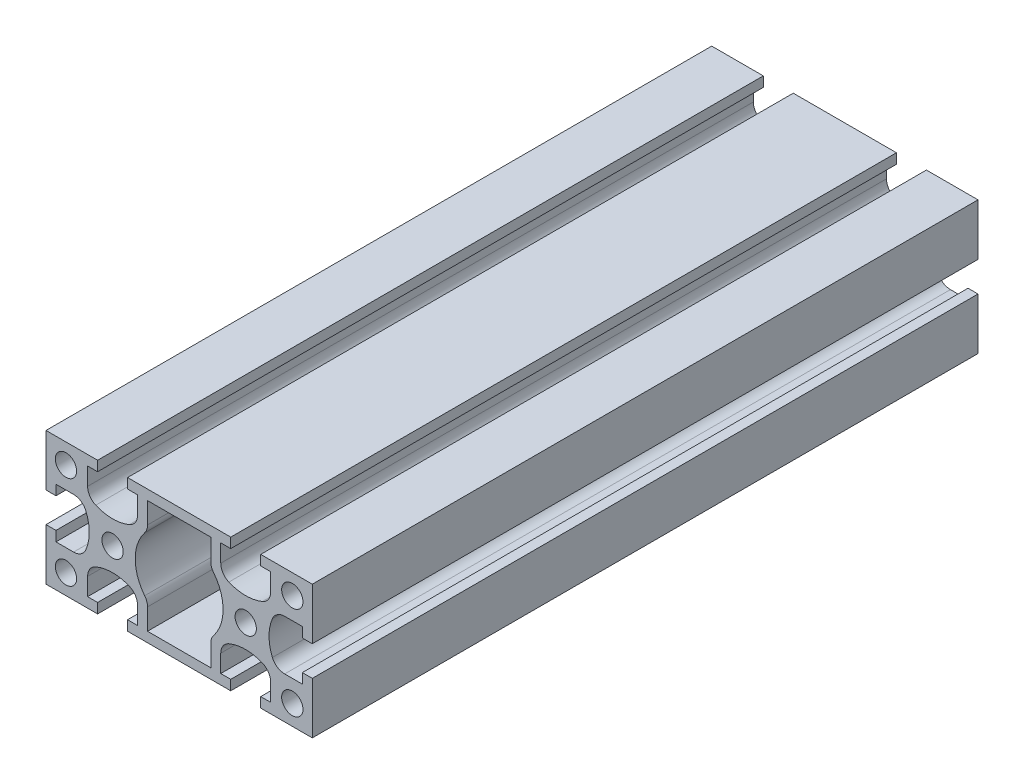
ISO-10303-21;
HEADER;
FILE_DESCRIPTION(('STEP AP214'),'2;1');
FILE_NAME('part.step','',(''),(''),'','','');
FILE_SCHEMA(('AUTOMOTIVE_DESIGN { 1 0 10303 214 1 1 1 1 }'));
ENDSEC;
DATA;
#1=APPLICATION_CONTEXT('core data for automotive mechanical design processes');
#2=APPLICATION_PROTOCOL_DEFINITION('international standard','automotive_design',2000,#1);
#3=PRODUCT_CONTEXT('',#1,'mechanical');
#4=PRODUCT('Part','Part','',(#3));
#5=PRODUCT_RELATED_PRODUCT_CATEGORY('part','',(#4));
#6=PRODUCT_DEFINITION_FORMATION('','',#4);
#7=PRODUCT_DEFINITION_CONTEXT('part definition',#1,'design');
#8=PRODUCT_DEFINITION('design','',#6,#7);
#9=PRODUCT_DEFINITION_SHAPE('','',#8);
#10=(LENGTH_UNIT() NAMED_UNIT(*) SI_UNIT(.MILLI.,.METRE.));
#11=(NAMED_UNIT(*) PLANE_ANGLE_UNIT() SI_UNIT($,.RADIAN.));
#12=(NAMED_UNIT(*) SI_UNIT($,.STERADIAN.) SOLID_ANGLE_UNIT());
#13=UNCERTAINTY_MEASURE_WITH_UNIT(LENGTH_MEASURE(1.E-05),#10,'distance_accuracy_value','');
#14=(GEOMETRIC_REPRESENTATION_CONTEXT(3) GLOBAL_UNCERTAINTY_ASSIGNED_CONTEXT((#13)) GLOBAL_UNIT_ASSIGNED_CONTEXT((#10,
#11,#12)) REPRESENTATION_CONTEXT('',''));
#15=CARTESIAN_POINT('',(0.,0.,0.));
#16=DIRECTION('',(0.,0.,1.));
#17=DIRECTION('',(1.,0.,0.));
#18=AXIS2_PLACEMENT_3D('',#15,#16,#17);
#19=CARTESIAN_POINT('',(-9.99999999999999,10.,50.));
#20=DIRECTION('',(0.,0.,-1.));
#21=DIRECTION('',(-1.,0.,0.));
#22=AXIS2_PLACEMENT_3D('',#19,#20,#21);
#23=PLANE('',#22);
#24=CARTESIAN_POINT('',(-17.,-6.99999999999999,50.));
#25=DIRECTION('',(0.,0.,1.));
#26=DIRECTION('',(1.,0.,0.));
#27=AXIS2_PLACEMENT_3D('',#24,#25,#26);
#28=CIRCLE('',#27,1.6);
#29=CARTESIAN_POINT('',(-15.4,-6.99999999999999,50.));
#30=VERTEX_POINT('',#29);
#31=EDGE_CURVE('E2128',#30,#30,#28,.T.);
#32=ORIENTED_EDGE('',*,*,#31,.F.);
#33=EDGE_LOOP('',(#32));
#34=FACE_BOUND('',#33,.T.);
#35=CARTESIAN_POINT('',(17.,-7.,50.));
#36=DIRECTION('',(0.,0.,1.));
#37=DIRECTION('',(-1.,0.,0.));
#38=AXIS2_PLACEMENT_3D('',#35,#36,#37);
#39=CIRCLE('',#38,1.6);
#40=CARTESIAN_POINT('',(15.4,-7.,50.));
#41=VERTEX_POINT('',#40);
#42=EDGE_CURVE('E555',#41,#41,#39,.T.);
#43=ORIENTED_EDGE('',*,*,#42,.F.);
#44=EDGE_LOOP('',(#43));
#45=FACE_BOUND('',#44,.T.);
#46=CARTESIAN_POINT('',(17.,7.,50.));
#47=DIRECTION('',(0.,0.,1.));
#48=DIRECTION('',(1.,0.,0.));
#49=AXIS2_PLACEMENT_3D('',#46,#47,#48);
#50=CIRCLE('',#49,1.6);
#51=CARTESIAN_POINT('',(18.6,7.,50.));
#52=VERTEX_POINT('',#51);
#53=EDGE_CURVE('E578',#52,#52,#50,.T.);
#54=ORIENTED_EDGE('',*,*,#53,.F.);
#55=EDGE_LOOP('',(#54));
#56=FACE_BOUND('',#55,.T.);
#57=DIRECTION('',(-1.,0.,0.));
#58=VECTOR('',#57,1.);
#59=CARTESIAN_POINT('',(7.75,10.,50.));
#60=LINE('',#59,#58);
#61=CARTESIAN_POINT('',(7.75,10.,50.));
#62=VERTEX_POINT('',#61);
#63=CARTESIAN_POINT('',(-7.75,10.,50.));
#64=VERTEX_POINT('',#63);
#65=EDGE_CURVE('E590',#62,#64,#60,.T.);
#66=ORIENTED_EDGE('',*,*,#65,.T.);
#67=DIRECTION('',(0.,-1.,0.));
#68=VECTOR('',#67,1.);
#69=CARTESIAN_POINT('',(-7.75,10.,50.));
#70=LINE('',#69,#68);
#71=CARTESIAN_POINT('',(-7.75,8.5,50.));
#72=VERTEX_POINT('',#71);
#73=EDGE_CURVE('E593',#64,#72,#70,.T.);
#74=ORIENTED_EDGE('',*,*,#73,.T.);
#75=DIRECTION('',(1.,0.,0.));
#76=VECTOR('',#75,1.);
#77=CARTESIAN_POINT('',(-6.25,8.5,50.));
#78=LINE('',#77,#76);
#79=CARTESIAN_POINT('',(-6.25,8.5,50.));
#80=VERTEX_POINT('',#79);
#81=EDGE_CURVE('E596',#72,#80,#78,.T.);
#82=ORIENTED_EDGE('',*,*,#81,.T.);
#83=DIRECTION('',(0.,-1.,0.));
#84=VECTOR('',#83,1.);
#85=CARTESIAN_POINT('',(-6.25,8.5,50.));
#86=LINE('',#85,#84);
#87=CARTESIAN_POINT('',(-6.25,5.85421901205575,50.));
#88=VERTEX_POINT('',#87);
#89=EDGE_CURVE('E598',#80,#88,#86,.T.);
#90=ORIENTED_EDGE('',*,*,#89,.T.);
#91=CARTESIAN_POINT('',(-8.24999999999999,5.85421901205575,50.));
#92=DIRECTION('',(0.,0.,-1.));
#93=DIRECTION('',(-1.,0.,0.));
#94=AXIS2_PLACEMENT_3D('',#91,#92,#93);
#95=CIRCLE('',#94,2.);
#96=CARTESIAN_POINT('',(-7.47222222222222,4.01164968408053,50.));
#97=VERTEX_POINT('',#96);
#98=EDGE_CURVE('E1058',#88,#97,#95,.T.);
#99=ORIENTED_EDGE('',*,*,#98,.T.);
#100=CARTESIAN_POINT('',(-9.99999999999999,10.,50.));
#101=DIRECTION('',(0.,0.,-1.));
#102=DIRECTION('',(-1.,0.,0.));
#103=AXIS2_PLACEMENT_3D('',#100,#101,#102);
#104=CIRCLE('',#103,6.5);
#105=CARTESIAN_POINT('',(-12.5277777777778,4.01164968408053,50.));
#106=VERTEX_POINT('',#105);
#107=EDGE_CURVE('E601',#97,#106,#104,.T.);
#108=ORIENTED_EDGE('',*,*,#107,.T.);
#109=CARTESIAN_POINT('',(-11.75,5.85421901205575,50.));
#110=DIRECTION('',(0.,0.,-1.));
#111=DIRECTION('',(-1.,0.,0.));
#112=AXIS2_PLACEMENT_3D('',#109,#110,#111);
#113=CIRCLE('',#112,2.);
#114=CARTESIAN_POINT('',(-13.75,5.85421901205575,50.));
#115=VERTEX_POINT('',#114);
#116=EDGE_CURVE('E1054',#106,#115,#113,.T.);
#117=ORIENTED_EDGE('',*,*,#116,.T.);
#118=DIRECTION('',(0.,1.,0.));
#119=VECTOR('',#118,1.);
#120=CARTESIAN_POINT('',(-13.75,8.5,50.));
#121=LINE('',#120,#119);
#122=CARTESIAN_POINT('',(-13.75,8.5,50.));
#123=VERTEX_POINT('',#122);
#124=EDGE_CURVE('E604',#115,#123,#121,.T.);
#125=ORIENTED_EDGE('',*,*,#124,.T.);
#126=DIRECTION('',(1.,0.,0.));
#127=VECTOR('',#126,1.);
#128=CARTESIAN_POINT('',(-12.25,8.5,50.));
#129=LINE('',#128,#127);
#130=CARTESIAN_POINT('',(-12.25,8.5,50.));
#131=VERTEX_POINT('',#130);
#132=EDGE_CURVE('E606',#123,#131,#129,.T.);
#133=ORIENTED_EDGE('',*,*,#132,.T.);
#134=DIRECTION('',(0.,1.,0.));
#135=VECTOR('',#134,1.);
#136=CARTESIAN_POINT('',(-12.25,10.,50.));
#137=LINE('',#136,#135);
#138=CARTESIAN_POINT('',(-12.25,10.,50.));
#139=VERTEX_POINT('',#138);
#140=EDGE_CURVE('E608',#131,#139,#137,.T.);
#141=ORIENTED_EDGE('',*,*,#140,.T.);
#142=DIRECTION('',(-1.,0.,0.));
#143=VECTOR('',#142,1.);
#144=CARTESIAN_POINT('',(-12.25,10.,50.));
#145=LINE('',#144,#143);
#146=CARTESIAN_POINT('',(-20.,10.,50.));
#147=VERTEX_POINT('',#146);
#148=EDGE_CURVE('E610',#139,#147,#145,.T.);
#149=ORIENTED_EDGE('',*,*,#148,.T.);
#150=DIRECTION('',(0.,-1.,0.));
#151=VECTOR('',#150,1.);
#152=CARTESIAN_POINT('',(-20.,10.,50.));
#153=LINE('',#152,#151);
#154=CARTESIAN_POINT('',(-20.,2.25000000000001,50.));
#155=VERTEX_POINT('',#154);
#156=EDGE_CURVE('E612',#147,#155,#153,.T.);
#157=ORIENTED_EDGE('',*,*,#156,.T.);
#158=DIRECTION('',(1.,0.,0.));
#159=VECTOR('',#158,1.);
#160=CARTESIAN_POINT('',(-18.5,2.25000000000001,50.));
#161=LINE('',#160,#159);
#162=CARTESIAN_POINT('',(-18.5,2.25000000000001,50.));
#163=VERTEX_POINT('',#162);
#164=EDGE_CURVE('E614',#155,#163,#161,.T.);
#165=ORIENTED_EDGE('',*,*,#164,.T.);
#166=DIRECTION('',(0.,1.,0.));
#167=VECTOR('',#166,1.);
#168=CARTESIAN_POINT('',(-18.5,3.75000000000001,50.));
#169=LINE('',#168,#167);
#170=CARTESIAN_POINT('',(-18.5,3.75000000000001,50.));
#171=VERTEX_POINT('',#170);
#172=EDGE_CURVE('E616',#163,#171,#169,.T.);
#173=ORIENTED_EDGE('',*,*,#172,.T.);
#174=DIRECTION('',(1.,0.,0.));
#175=VECTOR('',#174,1.);
#176=CARTESIAN_POINT('',(-14.6908098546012,3.75000000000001,50.));
#177=LINE('',#176,#175);
#178=CARTESIAN_POINT('',(-15.8542190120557,3.75000000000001,50.));
#179=VERTEX_POINT('',#178);
#180=EDGE_CURVE('E618',#171,#179,#177,.T.);
#181=ORIENTED_EDGE('',*,*,#180,.T.);
#182=CARTESIAN_POINT('',(-15.8542190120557,1.75000000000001,50.));
#183=DIRECTION('',(0.,0.,-1.));
#184=DIRECTION('',(-1.,0.,0.));
#185=AXIS2_PLACEMENT_3D('',#182,#183,#184);
#186=CIRCLE('',#185,2.);
#187=CARTESIAN_POINT('',(-14.0116496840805,2.52777777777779,50.));
#188=VERTEX_POINT('',#187);
#189=EDGE_CURVE('E1050',#179,#188,#186,.T.);
#190=ORIENTED_EDGE('',*,*,#189,.T.);
#191=CARTESIAN_POINT('',(-20.,0.,50.));
#192=DIRECTION('',(0.,0.,-1.));
#193=DIRECTION('',(-1.,0.,0.));
#194=AXIS2_PLACEMENT_3D('',#191,#192,#193);
#195=CIRCLE('',#194,6.5);
#196=CARTESIAN_POINT('',(-14.0116496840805,-2.52777777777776,50.));
#197=VERTEX_POINT('',#196);
#198=EDGE_CURVE('E621',#188,#197,#195,.T.);
#199=ORIENTED_EDGE('',*,*,#198,.T.);
#200=CARTESIAN_POINT('',(-15.8542190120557,-1.74999999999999,50.));
#201=DIRECTION('',(0.,0.,-1.));
#202=DIRECTION('',(-1.,0.,0.));
#203=AXIS2_PLACEMENT_3D('',#200,#201,#202);
#204=CIRCLE('',#203,2.);
#205=CARTESIAN_POINT('',(-15.8542190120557,-3.74999999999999,50.));
#206=VERTEX_POINT('',#205);
#207=EDGE_CURVE('E1046',#197,#206,#204,.T.);
#208=ORIENTED_EDGE('',*,*,#207,.T.);
#209=DIRECTION('',(-1.,0.,0.));
#210=VECTOR('',#209,1.);
#211=CARTESIAN_POINT('',(-14.6908098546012,-3.74999999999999,50.));
#212=LINE('',#211,#210);
#213=CARTESIAN_POINT('',(-18.5,-3.74999999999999,50.));
#214=VERTEX_POINT('',#213);
#215=EDGE_CURVE('E624',#206,#214,#212,.T.);
#216=ORIENTED_EDGE('',*,*,#215,.T.);
#217=DIRECTION('',(0.,1.,0.));
#218=VECTOR('',#217,1.);
#219=CARTESIAN_POINT('',(-18.5,-3.74999999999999,50.));
#220=LINE('',#219,#218);
#221=CARTESIAN_POINT('',(-18.5,-2.24999999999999,50.));
#222=VERTEX_POINT('',#221);
#223=EDGE_CURVE('E626',#214,#222,#220,.T.);
#224=ORIENTED_EDGE('',*,*,#223,.T.);
#225=DIRECTION('',(-1.,0.,0.));
#226=VECTOR('',#225,1.);
#227=CARTESIAN_POINT('',(-18.5,-2.24999999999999,50.));
#228=LINE('',#227,#226);
#229=CARTESIAN_POINT('',(-20.,-2.24999999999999,50.));
#230=VERTEX_POINT('',#229);
#231=EDGE_CURVE('E628',#222,#230,#228,.T.);
#232=ORIENTED_EDGE('',*,*,#231,.T.);
#233=DIRECTION('',(0.,-1.,0.));
#234=VECTOR('',#233,1.);
#235=CARTESIAN_POINT('',(-20.,-9.99999999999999,50.));
#236=LINE('',#235,#234);
#237=CARTESIAN_POINT('',(-20.,-9.99999999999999,50.));
#238=VERTEX_POINT('',#237);
#239=EDGE_CURVE('E630',#230,#238,#236,.T.);
#240=ORIENTED_EDGE('',*,*,#239,.T.);
#241=DIRECTION('',(1.,0.,0.));
#242=VECTOR('',#241,1.);
#243=CARTESIAN_POINT('',(-12.25,-9.99999999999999,50.));
#244=LINE('',#243,#242);
#245=CARTESIAN_POINT('',(-12.25,-9.99999999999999,50.));
#246=VERTEX_POINT('',#245);
#247=EDGE_CURVE('E632',#238,#246,#244,.T.);
#248=ORIENTED_EDGE('',*,*,#247,.T.);
#249=DIRECTION('',(0.,1.,0.));
#250=VECTOR('',#249,1.);
#251=CARTESIAN_POINT('',(-12.25,-9.99999999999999,50.));
#252=LINE('',#251,#250);
#253=CARTESIAN_POINT('',(-12.25,-8.49999999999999,50.));
#254=VERTEX_POINT('',#253);
#255=EDGE_CURVE('E634',#246,#254,#252,.T.);
#256=ORIENTED_EDGE('',*,*,#255,.T.);
#257=DIRECTION('',(-1.,0.,0.));
#258=VECTOR('',#257,1.);
#259=CARTESIAN_POINT('',(-12.25,-8.49999999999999,50.));
#260=LINE('',#259,#258);
#261=CARTESIAN_POINT('',(-13.75,-8.49999999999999,50.));
#262=VERTEX_POINT('',#261);
#263=EDGE_CURVE('E636',#254,#262,#260,.T.);
#264=ORIENTED_EDGE('',*,*,#263,.T.);
#265=DIRECTION('',(0.,1.,0.));
#266=VECTOR('',#265,1.);
#267=CARTESIAN_POINT('',(-13.75,-8.49999999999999,50.));
#268=LINE('',#267,#266);
#269=CARTESIAN_POINT('',(-13.75,-5.85421901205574,50.));
#270=VERTEX_POINT('',#269);
#271=EDGE_CURVE('E638',#262,#270,#268,.T.);
#272=ORIENTED_EDGE('',*,*,#271,.T.);
#273=CARTESIAN_POINT('',(-11.75,-5.85421901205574,50.));
#274=DIRECTION('',(0.,0.,-1.));
#275=DIRECTION('',(-1.,0.,0.));
#276=AXIS2_PLACEMENT_3D('',#273,#274,#275);
#277=CIRCLE('',#276,2.);
#278=CARTESIAN_POINT('',(-12.5277777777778,-4.01164968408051,50.));
#279=VERTEX_POINT('',#278);
#280=EDGE_CURVE('E1042',#270,#279,#277,.T.);
#281=ORIENTED_EDGE('',*,*,#280,.T.);
#282=CARTESIAN_POINT('',(-9.99999999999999,-9.99999999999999,50.));
#283=DIRECTION('',(0.,0.,-1.));
#284=DIRECTION('',(1.,0.,0.));
#285=AXIS2_PLACEMENT_3D('',#282,#283,#284);
#286=CIRCLE('',#285,6.5);
#287=CARTESIAN_POINT('',(-7.47222222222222,-4.01164968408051,50.));
#288=VERTEX_POINT('',#287);
#289=EDGE_CURVE('E641',#279,#288,#286,.T.);
#290=ORIENTED_EDGE('',*,*,#289,.T.);
#291=CARTESIAN_POINT('',(-8.24999999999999,-5.85421901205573,50.));
#292=DIRECTION('',(0.,0.,-1.));
#293=DIRECTION('',(-1.,0.,0.));
#294=AXIS2_PLACEMENT_3D('',#291,#292,#293);
#295=CIRCLE('',#294,2.);
#296=CARTESIAN_POINT('',(-6.25,-5.85421901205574,50.));
#297=VERTEX_POINT('',#296);
#298=EDGE_CURVE('E1038',#288,#297,#295,.T.);
#299=ORIENTED_EDGE('',*,*,#298,.T.);
#300=DIRECTION('',(0.,-1.,0.));
#301=VECTOR('',#300,1.);
#302=CARTESIAN_POINT('',(-6.25,-8.49999999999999,50.));
#303=LINE('',#302,#301);
#304=CARTESIAN_POINT('',(-6.25,-8.49999999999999,50.));
#305=VERTEX_POINT('',#304);
#306=EDGE_CURVE('E644',#297,#305,#303,.T.);
#307=ORIENTED_EDGE('',*,*,#306,.T.);
#308=DIRECTION('',(-1.,0.,0.));
#309=VECTOR('',#308,1.);
#310=CARTESIAN_POINT('',(-6.25,-8.49999999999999,50.));
#311=LINE('',#310,#309);
#312=CARTESIAN_POINT('',(-7.75,-8.49999999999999,50.));
#313=VERTEX_POINT('',#312);
#314=EDGE_CURVE('E646',#305,#313,#311,.T.);
#315=ORIENTED_EDGE('',*,*,#314,.T.);
#316=DIRECTION('',(0.,-1.,0.));
#317=VECTOR('',#316,1.);
#318=CARTESIAN_POINT('',(-7.75,-9.99999999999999,50.));
#319=LINE('',#318,#317);
#320=CARTESIAN_POINT('',(-7.75,-9.99999999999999,50.));
#321=VERTEX_POINT('',#320);
#322=EDGE_CURVE('E648',#313,#321,#319,.T.);
#323=ORIENTED_EDGE('',*,*,#322,.T.);
#324=DIRECTION('',(1.,0.,0.));
#325=VECTOR('',#324,1.);
#326=CARTESIAN_POINT('',(7.75,-10.,50.));
#327=LINE('',#326,#325);
#328=CARTESIAN_POINT('',(7.75,-10.,50.));
#329=VERTEX_POINT('',#328);
#330=EDGE_CURVE('E650',#321,#329,#327,.T.);
#331=ORIENTED_EDGE('',*,*,#330,.T.);
#332=DIRECTION('',(0.,1.,0.));
#333=VECTOR('',#332,1.);
#334=CARTESIAN_POINT('',(7.75,-10.,50.));
#335=LINE('',#334,#333);
#336=CARTESIAN_POINT('',(7.75,-8.5,50.));
#337=VERTEX_POINT('',#336);
#338=EDGE_CURVE('E652',#329,#337,#335,.T.);
#339=ORIENTED_EDGE('',*,*,#338,.T.);
#340=DIRECTION('',(-1.,0.,0.));
#341=VECTOR('',#340,1.);
#342=CARTESIAN_POINT('',(6.25,-8.5,50.));
#343=LINE('',#342,#341);
#344=CARTESIAN_POINT('',(6.25,-8.5,50.));
#345=VERTEX_POINT('',#344);
#346=EDGE_CURVE('E654',#337,#345,#343,.T.);
#347=ORIENTED_EDGE('',*,*,#346,.T.);
#348=DIRECTION('',(0.,1.,0.));
#349=VECTOR('',#348,1.);
#350=CARTESIAN_POINT('',(6.25,-8.5,50.));
#351=LINE('',#350,#349);
#352=CARTESIAN_POINT('',(6.25,-5.85421901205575,50.));
#353=VERTEX_POINT('',#352);
#354=EDGE_CURVE('E656',#345,#353,#351,.T.);
#355=ORIENTED_EDGE('',*,*,#354,.T.);
#356=CARTESIAN_POINT('',(8.25,-5.85421901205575,50.));
#357=DIRECTION('',(0.,0.,-1.));
#358=DIRECTION('',(-1.,0.,0.));
#359=AXIS2_PLACEMENT_3D('',#356,#357,#358);
#360=CIRCLE('',#359,2.);
#361=CARTESIAN_POINT('',(7.47222222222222,-4.01164968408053,50.));
#362=VERTEX_POINT('',#361);
#363=EDGE_CURVE('E1074',#353,#362,#360,.T.);
#364=ORIENTED_EDGE('',*,*,#363,.T.);
#365=CARTESIAN_POINT('',(10.,-10.,50.));
#366=DIRECTION('',(0.,0.,-1.));
#367=DIRECTION('',(-1.,0.,0.));
#368=AXIS2_PLACEMENT_3D('',#365,#366,#367);
#369=CIRCLE('',#368,6.5);
#370=CARTESIAN_POINT('',(12.5277777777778,-4.01164968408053,50.));
#371=VERTEX_POINT('',#370);
#372=EDGE_CURVE('E659',#362,#371,#369,.T.);
#373=ORIENTED_EDGE('',*,*,#372,.T.);
#374=CARTESIAN_POINT('',(11.75,-5.85421901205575,50.));
#375=DIRECTION('',(0.,0.,-1.));
#376=DIRECTION('',(-1.,0.,0.));
#377=AXIS2_PLACEMENT_3D('',#374,#375,#376);
#378=CIRCLE('',#377,2.);
#379=CARTESIAN_POINT('',(13.75,-5.85421901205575,50.));
#380=VERTEX_POINT('',#379);
#381=EDGE_CURVE('E1070',#371,#380,#378,.T.);
#382=ORIENTED_EDGE('',*,*,#381,.T.);
#383=DIRECTION('',(0.,-1.,0.));
#384=VECTOR('',#383,1.);
#385=CARTESIAN_POINT('',(13.75,-8.5,50.));
#386=LINE('',#385,#384);
#387=CARTESIAN_POINT('',(13.75,-8.5,50.));
#388=VERTEX_POINT('',#387);
#389=EDGE_CURVE('E662',#380,#388,#386,.T.);
#390=ORIENTED_EDGE('',*,*,#389,.T.);
#391=DIRECTION('',(-1.,0.,0.));
#392=VECTOR('',#391,1.);
#393=CARTESIAN_POINT('',(12.25,-8.5,50.));
#394=LINE('',#393,#392);
#395=CARTESIAN_POINT('',(12.25,-8.5,50.));
#396=VERTEX_POINT('',#395);
#397=EDGE_CURVE('E664',#388,#396,#394,.T.);
#398=ORIENTED_EDGE('',*,*,#397,.T.);
#399=DIRECTION('',(0.,-1.,0.));
#400=VECTOR('',#399,1.);
#401=CARTESIAN_POINT('',(12.25,-10.,50.));
#402=LINE('',#401,#400);
#403=CARTESIAN_POINT('',(12.25,-10.,50.));
#404=VERTEX_POINT('',#403);
#405=EDGE_CURVE('E666',#396,#404,#402,.T.);
#406=ORIENTED_EDGE('',*,*,#405,.T.);
#407=DIRECTION('',(1.,0.,0.));
#408=VECTOR('',#407,1.);
#409=CARTESIAN_POINT('',(12.25,-10.,50.));
#410=LINE('',#409,#408);
#411=CARTESIAN_POINT('',(20.,-10.,50.));
#412=VERTEX_POINT('',#411);
#413=EDGE_CURVE('E668',#404,#412,#410,.T.);
#414=ORIENTED_EDGE('',*,*,#413,.T.);
#415=DIRECTION('',(0.,1.,0.));
#416=VECTOR('',#415,1.);
#417=CARTESIAN_POINT('',(20.,-10.,50.));
#418=LINE('',#417,#416);
#419=CARTESIAN_POINT('',(20.,-2.25,50.));
#420=VERTEX_POINT('',#419);
#421=EDGE_CURVE('E670',#412,#420,#418,.T.);
#422=ORIENTED_EDGE('',*,*,#421,.T.);
#423=DIRECTION('',(-1.,0.,0.));
#424=VECTOR('',#423,1.);
#425=CARTESIAN_POINT('',(18.5,-2.25,50.));
#426=LINE('',#425,#424);
#427=CARTESIAN_POINT('',(18.5,-2.25,50.));
#428=VERTEX_POINT('',#427);
#429=EDGE_CURVE('E672',#420,#428,#426,.T.);
#430=ORIENTED_EDGE('',*,*,#429,.T.);
#431=DIRECTION('',(0.,-1.,0.));
#432=VECTOR('',#431,1.);
#433=CARTESIAN_POINT('',(18.5,-3.75,50.));
#434=LINE('',#433,#432);
#435=CARTESIAN_POINT('',(18.5,-3.75,50.));
#436=VERTEX_POINT('',#435);
#437=EDGE_CURVE('E674',#428,#436,#434,.T.);
#438=ORIENTED_EDGE('',*,*,#437,.T.);
#439=DIRECTION('',(-1.,0.,0.));
#440=VECTOR('',#439,1.);
#441=CARTESIAN_POINT('',(14.6908098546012,-3.75,50.));
#442=LINE('',#441,#440);
#443=CARTESIAN_POINT('',(15.8542190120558,-3.75,50.));
#444=VERTEX_POINT('',#443);
#445=EDGE_CURVE('E676',#436,#444,#442,.T.);
#446=ORIENTED_EDGE('',*,*,#445,.T.);
#447=CARTESIAN_POINT('',(15.8542190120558,-1.75,50.));
#448=DIRECTION('',(0.,0.,-1.));
#449=DIRECTION('',(-1.,0.,0.));
#450=AXIS2_PLACEMENT_3D('',#447,#448,#449);
#451=CIRCLE('',#450,2.);
#452=CARTESIAN_POINT('',(14.0116496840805,-2.52777777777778,50.));
#453=VERTEX_POINT('',#452);
#454=EDGE_CURVE('E11',#444,#453,#451,.T.);
#455=ORIENTED_EDGE('',*,*,#454,.T.);
#456=CARTESIAN_POINT('',(20.,0.,50.));
#457=DIRECTION('',(0.,0.,-1.));
#458=DIRECTION('',(1.,0.,0.));
#459=AXIS2_PLACEMENT_3D('',#456,#457,#458);
#460=CIRCLE('',#459,6.5);
#461=CARTESIAN_POINT('',(14.0116496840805,2.52777777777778,50.));
#462=VERTEX_POINT('',#461);
#463=EDGE_CURVE('E679',#453,#462,#460,.T.);
#464=ORIENTED_EDGE('',*,*,#463,.T.);
#465=CARTESIAN_POINT('',(15.8542190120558,1.75,50.));
#466=DIRECTION('',(0.,0.,-1.));
#467=DIRECTION('',(-1.,0.,0.));
#468=AXIS2_PLACEMENT_3D('',#465,#466,#467);
#469=CIRCLE('',#468,2.);
#470=CARTESIAN_POINT('',(15.8542190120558,3.75,50.));
#471=VERTEX_POINT('',#470);
#472=EDGE_CURVE('E1078',#462,#471,#469,.T.);
#473=ORIENTED_EDGE('',*,*,#472,.T.);
#474=DIRECTION('',(1.,0.,0.));
#475=VECTOR('',#474,1.);
#476=CARTESIAN_POINT('',(14.6908098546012,3.75,50.));
#477=LINE('',#476,#475);
#478=CARTESIAN_POINT('',(18.5,3.75,50.));
#479=VERTEX_POINT('',#478);
#480=EDGE_CURVE('E682',#471,#479,#477,.T.);
#481=ORIENTED_EDGE('',*,*,#480,.T.);
#482=DIRECTION('',(0.,-1.,0.));
#483=VECTOR('',#482,1.);
#484=CARTESIAN_POINT('',(18.5,3.75,50.));
#485=LINE('',#484,#483);
#486=CARTESIAN_POINT('',(18.5,2.25,50.));
#487=VERTEX_POINT('',#486);
#488=EDGE_CURVE('E684',#479,#487,#485,.T.);
#489=ORIENTED_EDGE('',*,*,#488,.T.);
#490=DIRECTION('',(1.,0.,0.));
#491=VECTOR('',#490,1.);
#492=CARTESIAN_POINT('',(18.5,2.25,50.));
#493=LINE('',#492,#491);
#494=CARTESIAN_POINT('',(20.,2.25,50.));
#495=VERTEX_POINT('',#494);
#496=EDGE_CURVE('E686',#487,#495,#493,.T.);
#497=ORIENTED_EDGE('',*,*,#496,.T.);
#498=DIRECTION('',(0.,1.,0.));
#499=VECTOR('',#498,1.);
#500=CARTESIAN_POINT('',(20.,10.,50.));
#501=LINE('',#500,#499);
#502=CARTESIAN_POINT('',(20.,10.,50.));
#503=VERTEX_POINT('',#502);
#504=EDGE_CURVE('E688',#495,#503,#501,.T.);
#505=ORIENTED_EDGE('',*,*,#504,.T.);
#506=DIRECTION('',(-1.,0.,0.));
#507=VECTOR('',#506,1.);
#508=CARTESIAN_POINT('',(12.25,10.,50.));
#509=LINE('',#508,#507);
#510=CARTESIAN_POINT('',(12.25,10.,50.));
#511=VERTEX_POINT('',#510);
#512=EDGE_CURVE('E690',#503,#511,#509,.T.);
#513=ORIENTED_EDGE('',*,*,#512,.T.);
#514=DIRECTION('',(0.,-1.,0.));
#515=VECTOR('',#514,1.);
#516=CARTESIAN_POINT('',(12.25,10.,50.));
#517=LINE('',#516,#515);
#518=CARTESIAN_POINT('',(12.25,8.5,50.));
#519=VERTEX_POINT('',#518);
#520=EDGE_CURVE('E692',#511,#519,#517,.T.);
#521=ORIENTED_EDGE('',*,*,#520,.T.);
#522=DIRECTION('',(1.,0.,0.));
#523=VECTOR('',#522,1.);
#524=CARTESIAN_POINT('',(12.25,8.5,50.));
#525=LINE('',#524,#523);
#526=CARTESIAN_POINT('',(13.75,8.5,50.));
#527=VERTEX_POINT('',#526);
#528=EDGE_CURVE('E694',#519,#527,#525,.T.);
#529=ORIENTED_EDGE('',*,*,#528,.T.);
#530=DIRECTION('',(0.,-1.,0.));
#531=VECTOR('',#530,1.);
#532=CARTESIAN_POINT('',(13.75,8.5,50.));
#533=LINE('',#532,#531);
#534=CARTESIAN_POINT('',(13.75,5.85421901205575,50.));
#535=VERTEX_POINT('',#534);
#536=EDGE_CURVE('E696',#527,#535,#533,.T.);
#537=ORIENTED_EDGE('',*,*,#536,.T.);
#538=CARTESIAN_POINT('',(11.75,5.85421901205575,50.));
#539=DIRECTION('',(0.,0.,-1.));
#540=DIRECTION('',(-1.,0.,0.));
#541=AXIS2_PLACEMENT_3D('',#538,#539,#540);
#542=CIRCLE('',#541,2.);
#543=CARTESIAN_POINT('',(12.5277777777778,4.01164968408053,50.));
#544=VERTEX_POINT('',#543);
#545=EDGE_CURVE('E1066',#535,#544,#542,.T.);
#546=ORIENTED_EDGE('',*,*,#545,.T.);
#547=CARTESIAN_POINT('',(10.,10.,50.));
#548=DIRECTION('',(0.,0.,-1.));
#549=DIRECTION('',(1.,0.,0.));
#550=AXIS2_PLACEMENT_3D('',#547,#548,#549);
#551=CIRCLE('',#550,6.5);
#552=CARTESIAN_POINT('',(7.47222222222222,4.01164968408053,50.));
#553=VERTEX_POINT('',#552);
#554=EDGE_CURVE('E699',#544,#553,#551,.T.);
#555=ORIENTED_EDGE('',*,*,#554,.T.);
#556=CARTESIAN_POINT('',(8.25,5.85421901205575,50.));
#557=DIRECTION('',(0.,0.,-1.));
#558=DIRECTION('',(-1.,0.,0.));
#559=AXIS2_PLACEMENT_3D('',#556,#557,#558);
#560=CIRCLE('',#559,2.);
#561=CARTESIAN_POINT('',(6.25,5.85421901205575,50.));
#562=VERTEX_POINT('',#561);
#563=EDGE_CURVE('E1062',#553,#562,#560,.T.);
#564=ORIENTED_EDGE('',*,*,#563,.T.);
#565=DIRECTION('',(0.,1.,0.));
#566=VECTOR('',#565,1.);
#567=CARTESIAN_POINT('',(6.25,8.5,50.));
#568=LINE('',#567,#566);
#569=CARTESIAN_POINT('',(6.25,8.5,50.));
#570=VERTEX_POINT('',#569);
#571=EDGE_CURVE('E702',#562,#570,#568,.T.);
#572=ORIENTED_EDGE('',*,*,#571,.T.);
#573=DIRECTION('',(1.,0.,0.));
#574=VECTOR('',#573,1.);
#575=CARTESIAN_POINT('',(6.25,8.5,50.));
#576=LINE('',#575,#574);
#577=CARTESIAN_POINT('',(7.75,8.5,50.));
#578=VERTEX_POINT('',#577);
#579=EDGE_CURVE('E704',#570,#578,#576,.T.);
#580=ORIENTED_EDGE('',*,*,#579,.T.);
#581=DIRECTION('',(0.,1.,0.));
#582=VECTOR('',#581,1.);
#583=CARTESIAN_POINT('',(7.75,10.,50.));
#584=LINE('',#583,#582);
#585=EDGE_CURVE('E706',#578,#62,#584,.T.);
#586=ORIENTED_EDGE('',*,*,#585,.T.);
#587=EDGE_LOOP('',(#66,#74,#82,#90,#99,#108,#117,#125,#133,#141,#149,#157,#165,#173,#181,#190,
#199,#208,#216,#224,#232,#240,#248,#256,#264,#272,#281,#290,#299,#307,#315,#323,#331,#339,#347,
#355,#364,#373,#382,#390,#398,#406,#414,#422,#430,#438,#446,#455,#464,#473,#481,#489,#497,#505,
#513,#521,#529,#537,#546,#555,#564,#572,#580,#586));
#588=FACE_BOUND('',#587,.T.);
#589=CARTESIAN_POINT('',(10.,0.,50.));
#590=DIRECTION('',(0.,0.,1.));
#591=DIRECTION('',(1.,0.,0.));
#592=AXIS2_PLACEMENT_3D('',#589,#590,#591);
#593=CIRCLE('',#592,1.6);
#594=CARTESIAN_POINT('',(11.6,0.,50.));
#595=VERTEX_POINT('',#594);
#596=EDGE_CURVE('E584',#595,#595,#593,.T.);
#597=ORIENTED_EDGE('',*,*,#596,.F.);
#598=EDGE_LOOP('',(#597));
#599=FACE_BOUND('',#598,.T.);
#600=DIRECTION('',(0.,-1.,0.));
#601=VECTOR('',#600,1.);
#602=CARTESIAN_POINT('',(-4.75,-8.49999999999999,50.));
#603=LINE('',#602,#601);
#604=CARTESIAN_POINT('',(-4.75,-5.32893047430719,50.));
#605=VERTEX_POINT('',#604);
#606=CARTESIAN_POINT('',(-4.75,-8.49999999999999,50.));
#607=VERTEX_POINT('',#606);
#608=EDGE_CURVE('E543',#605,#607,#603,.T.);
#609=ORIENTED_EDGE('',*,*,#608,.F.);
#610=CARTESIAN_POINT('',(-6.75,-5.3289304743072,50.));
#611=DIRECTION('',(0.,0.,-1.));
#612=DIRECTION('',(-1.,0.,0.));
#613=AXIS2_PLACEMENT_3D('',#610,#611,#612);
#614=CIRCLE('',#613,2.);
#615=CARTESIAN_POINT('',(-5.18023255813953,-4.08964431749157,50.));
#616=VERTEX_POINT('',#615);
#617=EDGE_CURVE('E1022',#605,#616,#614,.F.);
#618=ORIENTED_EDGE('',*,*,#617,.T.);
#619=CARTESIAN_POINT('',(0.,0.,50.));
#620=DIRECTION('',(0.,0.,1.));
#621=DIRECTION('',(-1.,0.,0.));
#622=AXIS2_PLACEMENT_3D('',#619,#620,#621);
#623=CIRCLE('',#622,6.59999999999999);
#624=CARTESIAN_POINT('',(-5.18023255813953,4.08964431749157,50.));
#625=VERTEX_POINT('',#624);
#626=EDGE_CURVE('E537',#625,#616,#623,.T.);
#627=ORIENTED_EDGE('',*,*,#626,.F.);
#628=CARTESIAN_POINT('',(-6.75,5.3289304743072,50.));
#629=DIRECTION('',(0.,0.,-1.));
#630=DIRECTION('',(-1.,0.,0.));
#631=AXIS2_PLACEMENT_3D('',#628,#629,#630);
#632=CIRCLE('',#631,2.);
#633=CARTESIAN_POINT('',(-4.75,5.32893047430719,50.));
#634=VERTEX_POINT('',#633);
#635=EDGE_CURVE('E52',#625,#634,#632,.F.);
#636=ORIENTED_EDGE('',*,*,#635,.T.);
#637=DIRECTION('',(0.,-1.,0.));
#638=VECTOR('',#637,1.);
#639=CARTESIAN_POINT('',(-4.75,8.5,50.));
#640=LINE('',#639,#638);
#641=CARTESIAN_POINT('',(-4.75,8.5,50.));
#642=VERTEX_POINT('',#641);
#643=EDGE_CURVE('E535',#642,#634,#640,.T.);
#644=ORIENTED_EDGE('',*,*,#643,.F.);
#645=DIRECTION('',(-1.,0.,0.));
#646=VECTOR('',#645,1.);
#647=CARTESIAN_POINT('',(-4.75,8.5,50.));
#648=LINE('',#647,#646);
#649=CARTESIAN_POINT('',(4.75,8.5,50.));
#650=VERTEX_POINT('',#649);
#651=EDGE_CURVE('E521',#650,#642,#648,.T.);
#652=ORIENTED_EDGE('',*,*,#651,.F.);
#653=DIRECTION('',(0.,1.,0.));
#654=VECTOR('',#653,1.);
#655=CARTESIAN_POINT('',(4.75,8.5,50.));
#656=LINE('',#655,#654);
#657=CARTESIAN_POINT('',(4.75,5.3289304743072,50.));
#658=VERTEX_POINT('',#657);
#659=EDGE_CURVE('E512',#658,#650,#656,.T.);
#660=ORIENTED_EDGE('',*,*,#659,.F.);
#661=CARTESIAN_POINT('',(6.75,5.3289304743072,50.));
#662=DIRECTION('',(0.,0.,-1.));
#663=DIRECTION('',(-1.,0.,0.));
#664=AXIS2_PLACEMENT_3D('',#661,#662,#663);
#665=CIRCLE('',#664,2.);
#666=CARTESIAN_POINT('',(5.18023255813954,4.08964431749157,50.));
#667=VERTEX_POINT('',#666);
#668=EDGE_CURVE('E1018',#658,#667,#665,.F.);
#669=ORIENTED_EDGE('',*,*,#668,.T.);
#670=CARTESIAN_POINT('',(0.,0.,50.));
#671=DIRECTION('',(0.,0.,1.));
#672=DIRECTION('',(1.,0.,0.));
#673=AXIS2_PLACEMENT_3D('',#670,#671,#672);
#674=CIRCLE('',#673,6.6);
#675=CARTESIAN_POINT('',(5.18023255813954,-4.08964431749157,50.));
#676=VERTEX_POINT('',#675);
#677=EDGE_CURVE('E549',#676,#667,#674,.T.);
#678=ORIENTED_EDGE('',*,*,#677,.F.);
#679=CARTESIAN_POINT('',(6.75,-5.3289304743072,50.));
#680=DIRECTION('',(0.,0.,-1.));
#681=DIRECTION('',(-1.,0.,0.));
#682=AXIS2_PLACEMENT_3D('',#679,#680,#681);
#683=CIRCLE('',#682,2.);
#684=CARTESIAN_POINT('',(4.75,-5.3289304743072,50.));
#685=VERTEX_POINT('',#684);
#686=EDGE_CURVE('E59',#676,#685,#683,.F.);
#687=ORIENTED_EDGE('',*,*,#686,.T.);
#688=DIRECTION('',(0.,1.,0.));
#689=VECTOR('',#688,1.);
#690=CARTESIAN_POINT('',(4.75,-8.5,50.));
#691=LINE('',#690,#689);
#692=CARTESIAN_POINT('',(4.75,-8.5,50.));
#693=VERTEX_POINT('',#692);
#694=EDGE_CURVE('E547',#693,#685,#691,.T.);
#695=ORIENTED_EDGE('',*,*,#694,.F.);
#696=DIRECTION('',(1.,0.,0.));
#697=VECTOR('',#696,1.);
#698=CARTESIAN_POINT('',(-4.75,-8.49999999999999,50.));
#699=LINE('',#698,#697);
#700=EDGE_CURVE('E545',#607,#693,#699,.T.);
#701=ORIENTED_EDGE('',*,*,#700,.F.);
#702=EDGE_LOOP('',(#609,#618,#627,#636,#644,#652,#660,#669,#678,#687,#695,#701));
#703=FACE_BOUND('',#702,.T.);
#704=CARTESIAN_POINT('',(-9.99999999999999,0.,50.));
#705=DIRECTION('',(0.,0.,1.));
#706=DIRECTION('',(-1.,0.,0.));
#707=AXIS2_PLACEMENT_3D('',#704,#705,#706);
#708=CIRCLE('',#707,1.6);
#709=CARTESIAN_POINT('',(-11.6,0.,50.));
#710=VERTEX_POINT('',#709);
#711=EDGE_CURVE('E2133',#710,#710,#708,.T.);
#712=ORIENTED_EDGE('',*,*,#711,.F.);
#713=EDGE_LOOP('',(#712));
#714=FACE_BOUND('',#713,.T.);
#715=CARTESIAN_POINT('',(-17.,7.,50.));
#716=DIRECTION('',(0.,0.,1.));
#717=DIRECTION('',(-1.,0.,0.));
#718=AXIS2_PLACEMENT_3D('',#715,#716,#717);
#719=CIRCLE('',#718,1.6);
#720=CARTESIAN_POINT('',(-18.6,7.,50.));
#721=VERTEX_POINT('',#720);
#722=EDGE_CURVE('E2122',#721,#721,#719,.T.);
#723=ORIENTED_EDGE('',*,*,#722,.F.);
#724=EDGE_LOOP('',(#723));
#725=FACE_BOUND('',#724,.T.);
#726=ADVANCED_FACE('F37',(#34,#45,#56,#588,#599,#703,#714,#725),#23,.F.);
#727=CARTESIAN_POINT('',(-9.99999999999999,10.,-50.));
#728=DIRECTION('',(0.,0.,-1.));
#729=DIRECTION('',(-1.,0.,0.));
#730=AXIS2_PLACEMENT_3D('',#727,#728,#729);
#731=PLANE('',#730);
#732=CARTESIAN_POINT('',(-17.,-6.99999999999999,-50.));
#733=DIRECTION('',(0.,0.,1.));
#734=DIRECTION('',(1.,0.,0.));
#735=AXIS2_PLACEMENT_3D('',#732,#733,#734);
#736=CIRCLE('',#735,1.6);
#737=CARTESIAN_POINT('',(-15.4,-6.99999999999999,-50.));
#738=VERTEX_POINT('',#737);
#739=EDGE_CURVE('E2125',#738,#738,#736,.T.);
#740=ORIENTED_EDGE('',*,*,#739,.T.);
#741=EDGE_LOOP('',(#740));
#742=FACE_BOUND('',#741,.T.);
#743=CARTESIAN_POINT('',(17.,-7.,-50.));
#744=DIRECTION('',(0.,0.,1.));
#745=DIRECTION('',(-1.,0.,0.));
#746=AXIS2_PLACEMENT_3D('',#743,#744,#745);
#747=CIRCLE('',#746,1.6);
#748=CARTESIAN_POINT('',(15.4,-7.,-50.));
#749=VERTEX_POINT('',#748);
#750=EDGE_CURVE('E2136',#749,#749,#747,.T.);
#751=ORIENTED_EDGE('',*,*,#750,.T.);
#752=EDGE_LOOP('',(#751));
#753=FACE_BOUND('',#752,.T.);
#754=CARTESIAN_POINT('',(17.,7.,-50.));
#755=DIRECTION('',(0.,0.,1.));
#756=DIRECTION('',(1.,0.,0.));
#757=AXIS2_PLACEMENT_3D('',#754,#755,#756);
#758=CIRCLE('',#757,1.6);
#759=CARTESIAN_POINT('',(18.6,7.,-50.));
#760=VERTEX_POINT('',#759);
#761=EDGE_CURVE('E530',#760,#760,#758,.T.);
#762=ORIENTED_EDGE('',*,*,#761,.T.);
#763=EDGE_LOOP('',(#762));
#764=FACE_BOUND('',#763,.T.);
#765=DIRECTION('',(-1.,0.,0.));
#766=VECTOR('',#765,1.);
#767=CARTESIAN_POINT('',(7.75,10.,-50.));
#768=LINE('',#767,#766);
#769=CARTESIAN_POINT('',(7.75,10.,-50.));
#770=VERTEX_POINT('',#769);
#771=CARTESIAN_POINT('',(-7.75,10.,-50.));
#772=VERTEX_POINT('',#771);
#773=EDGE_CURVE('E587',#770,#772,#768,.T.);
#774=ORIENTED_EDGE('',*,*,#773,.F.);
#775=DIRECTION('',(0.,1.,0.));
#776=VECTOR('',#775,1.);
#777=CARTESIAN_POINT('',(7.75,10.,-50.));
#778=LINE('',#777,#776);
#779=CARTESIAN_POINT('',(7.75,8.5,-50.));
#780=VERTEX_POINT('',#779);
#781=EDGE_CURVE('E594',#780,#770,#778,.T.);
#782=ORIENTED_EDGE('',*,*,#781,.F.);
#783=DIRECTION('',(1.,0.,0.));
#784=VECTOR('',#783,1.);
#785=CARTESIAN_POINT('',(6.25,8.5,-50.));
#786=LINE('',#785,#784);
#787=CARTESIAN_POINT('',(6.25,8.5,-50.));
#788=VERTEX_POINT('',#787);
#789=EDGE_CURVE('E821',#788,#780,#786,.T.);
#790=ORIENTED_EDGE('',*,*,#789,.F.);
#791=DIRECTION('',(0.,1.,0.));
#792=VECTOR('',#791,1.);
#793=CARTESIAN_POINT('',(6.25,8.5,-50.));
#794=LINE('',#793,#792);
#795=CARTESIAN_POINT('',(6.25,5.85421901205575,-50.));
#796=VERTEX_POINT('',#795);
#797=EDGE_CURVE('E819',#796,#788,#794,.T.);
#798=ORIENTED_EDGE('',*,*,#797,.F.);
#799=CARTESIAN_POINT('',(8.25,5.85421901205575,-50.));
#800=DIRECTION('',(0.,0.,-1.));
#801=DIRECTION('',(-1.,0.,0.));
#802=AXIS2_PLACEMENT_3D('',#799,#800,#801);
#803=CIRCLE('',#802,2.);
#804=CARTESIAN_POINT('',(7.47222222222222,4.01164968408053,-50.));
#805=VERTEX_POINT('',#804);
#806=EDGE_CURVE('E1060',#796,#805,#803,.F.);
#807=ORIENTED_EDGE('',*,*,#806,.T.);
#808=CARTESIAN_POINT('',(10.,10.,-50.));
#809=DIRECTION('',(0.,0.,-1.));
#810=DIRECTION('',(1.,0.,0.));
#811=AXIS2_PLACEMENT_3D('',#808,#809,#810);
#812=CIRCLE('',#811,6.5);
#813=CARTESIAN_POINT('',(12.5277777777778,4.01164968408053,-50.));
#814=VERTEX_POINT('',#813);
#815=EDGE_CURVE('E816',#814,#805,#812,.T.);
#816=ORIENTED_EDGE('',*,*,#815,.F.);
#817=CARTESIAN_POINT('',(11.75,5.85421901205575,-50.));
#818=DIRECTION('',(0.,0.,-1.));
#819=DIRECTION('',(-1.,0.,0.));
#820=AXIS2_PLACEMENT_3D('',#817,#818,#819);
#821=CIRCLE('',#820,2.);
#822=CARTESIAN_POINT('',(13.75,5.85421901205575,-50.));
#823=VERTEX_POINT('',#822);
#824=EDGE_CURVE('E1064',#814,#823,#821,.F.);
#825=ORIENTED_EDGE('',*,*,#824,.T.);
#826=DIRECTION('',(0.,-1.,0.));
#827=VECTOR('',#826,1.);
#828=CARTESIAN_POINT('',(13.75,8.5,-50.));
#829=LINE('',#828,#827);
#830=CARTESIAN_POINT('',(13.75,8.5,-50.));
#831=VERTEX_POINT('',#830);
#832=EDGE_CURVE('E813',#831,#823,#829,.T.);
#833=ORIENTED_EDGE('',*,*,#832,.F.);
#834=DIRECTION('',(1.,0.,0.));
#835=VECTOR('',#834,1.);
#836=CARTESIAN_POINT('',(12.25,8.5,-50.));
#837=LINE('',#836,#835);
#838=CARTESIAN_POINT('',(12.25,8.5,-50.));
#839=VERTEX_POINT('',#838);
#840=EDGE_CURVE('E811',#839,#831,#837,.T.);
#841=ORIENTED_EDGE('',*,*,#840,.F.);
#842=DIRECTION('',(0.,-1.,0.));
#843=VECTOR('',#842,1.);
#844=CARTESIAN_POINT('',(12.25,10.,-50.));
#845=LINE('',#844,#843);
#846=CARTESIAN_POINT('',(12.25,10.,-50.));
#847=VERTEX_POINT('',#846);
#848=EDGE_CURVE('E809',#847,#839,#845,.T.);
#849=ORIENTED_EDGE('',*,*,#848,.F.);
#850=DIRECTION('',(-1.,0.,0.));
#851=VECTOR('',#850,1.);
#852=CARTESIAN_POINT('',(12.25,10.,-50.));
#853=LINE('',#852,#851);
#854=CARTESIAN_POINT('',(20.,10.,-50.));
#855=VERTEX_POINT('',#854);
#856=EDGE_CURVE('E807',#855,#847,#853,.T.);
#857=ORIENTED_EDGE('',*,*,#856,.F.);
#858=DIRECTION('',(0.,1.,0.));
#859=VECTOR('',#858,1.);
#860=CARTESIAN_POINT('',(20.,10.,-50.));
#861=LINE('',#860,#859);
#862=CARTESIAN_POINT('',(20.,2.25,-50.));
#863=VERTEX_POINT('',#862);
#864=EDGE_CURVE('E805',#863,#855,#861,.T.);
#865=ORIENTED_EDGE('',*,*,#864,.F.);
#866=DIRECTION('',(1.,0.,0.));
#867=VECTOR('',#866,1.);
#868=CARTESIAN_POINT('',(18.5,2.25,-50.));
#869=LINE('',#868,#867);
#870=CARTESIAN_POINT('',(18.5,2.25,-50.));
#871=VERTEX_POINT('',#870);
#872=EDGE_CURVE('E803',#871,#863,#869,.T.);
#873=ORIENTED_EDGE('',*,*,#872,.F.);
#874=DIRECTION('',(0.,-1.,0.));
#875=VECTOR('',#874,1.);
#876=CARTESIAN_POINT('',(18.5,3.75,-50.));
#877=LINE('',#876,#875);
#878=CARTESIAN_POINT('',(18.5,3.75,-50.));
#879=VERTEX_POINT('',#878);
#880=EDGE_CURVE('E801',#879,#871,#877,.T.);
#881=ORIENTED_EDGE('',*,*,#880,.F.);
#882=DIRECTION('',(1.,0.,0.));
#883=VECTOR('',#882,1.);
#884=CARTESIAN_POINT('',(14.6908098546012,3.75,-50.));
#885=LINE('',#884,#883);
#886=CARTESIAN_POINT('',(15.8542190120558,3.75,-50.));
#887=VERTEX_POINT('',#886);
#888=EDGE_CURVE('E799',#887,#879,#885,.T.);
#889=ORIENTED_EDGE('',*,*,#888,.F.);
#890=CARTESIAN_POINT('',(15.8542190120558,1.75,-50.));
#891=DIRECTION('',(0.,0.,-1.));
#892=DIRECTION('',(-1.,0.,0.));
#893=AXIS2_PLACEMENT_3D('',#890,#891,#892);
#894=CIRCLE('',#893,2.);
#895=CARTESIAN_POINT('',(14.0116496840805,2.52777777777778,-50.));
#896=VERTEX_POINT('',#895);
#897=EDGE_CURVE('E1076',#887,#896,#894,.F.);
#898=ORIENTED_EDGE('',*,*,#897,.T.);
#899=CARTESIAN_POINT('',(20.,0.,-50.));
#900=DIRECTION('',(0.,0.,-1.));
#901=DIRECTION('',(1.,0.,0.));
#902=AXIS2_PLACEMENT_3D('',#899,#900,#901);
#903=CIRCLE('',#902,6.5);
#904=CARTESIAN_POINT('',(14.0116496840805,-2.52777777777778,-50.));
#905=VERTEX_POINT('',#904);
#906=EDGE_CURVE('E796',#905,#896,#903,.T.);
#907=ORIENTED_EDGE('',*,*,#906,.F.);
#908=CARTESIAN_POINT('',(15.8542190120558,-1.75,-50.));
#909=DIRECTION('',(0.,0.,-1.));
#910=DIRECTION('',(-1.,0.,0.));
#911=AXIS2_PLACEMENT_3D('',#908,#909,#910);
#912=CIRCLE('',#911,2.);
#913=CARTESIAN_POINT('',(15.8542190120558,-3.75,-50.));
#914=VERTEX_POINT('',#913);
#915=EDGE_CURVE('E45',#905,#914,#912,.F.);
#916=ORIENTED_EDGE('',*,*,#915,.T.);
#917=DIRECTION('',(-1.,0.,0.));
#918=VECTOR('',#917,1.);
#919=CARTESIAN_POINT('',(14.6908098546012,-3.75,-50.));
#920=LINE('',#919,#918);
#921=CARTESIAN_POINT('',(18.5,-3.75,-50.));
#922=VERTEX_POINT('',#921);
#923=EDGE_CURVE('E793',#922,#914,#920,.T.);
#924=ORIENTED_EDGE('',*,*,#923,.F.);
#925=DIRECTION('',(0.,-1.,0.));
#926=VECTOR('',#925,1.);
#927=CARTESIAN_POINT('',(18.5,-3.75,-50.));
#928=LINE('',#927,#926);
#929=CARTESIAN_POINT('',(18.5,-2.25,-50.));
#930=VERTEX_POINT('',#929);
#931=EDGE_CURVE('E791',#930,#922,#928,.T.);
#932=ORIENTED_EDGE('',*,*,#931,.F.);
#933=DIRECTION('',(-1.,0.,0.));
#934=VECTOR('',#933,1.);
#935=CARTESIAN_POINT('',(18.5,-2.25,-50.));
#936=LINE('',#935,#934);
#937=CARTESIAN_POINT('',(20.,-2.25,-50.));
#938=VERTEX_POINT('',#937);
#939=EDGE_CURVE('E789',#938,#930,#936,.T.);
#940=ORIENTED_EDGE('',*,*,#939,.F.);
#941=DIRECTION('',(0.,1.,0.));
#942=VECTOR('',#941,1.);
#943=CARTESIAN_POINT('',(20.,-10.,-50.));
#944=LINE('',#943,#942);
#945=CARTESIAN_POINT('',(20.,-10.,-50.));
#946=VERTEX_POINT('',#945);
#947=EDGE_CURVE('E787',#946,#938,#944,.T.);
#948=ORIENTED_EDGE('',*,*,#947,.F.);
#949=DIRECTION('',(1.,0.,0.));
#950=VECTOR('',#949,1.);
#951=CARTESIAN_POINT('',(12.25,-10.,-50.));
#952=LINE('',#951,#950);
#953=CARTESIAN_POINT('',(12.25,-10.,-50.));
#954=VERTEX_POINT('',#953);
#955=EDGE_CURVE('E785',#954,#946,#952,.T.);
#956=ORIENTED_EDGE('',*,*,#955,.F.);
#957=DIRECTION('',(0.,-1.,0.));
#958=VECTOR('',#957,1.);
#959=CARTESIAN_POINT('',(12.25,-10.,-50.));
#960=LINE('',#959,#958);
#961=CARTESIAN_POINT('',(12.25,-8.5,-50.));
#962=VERTEX_POINT('',#961);
#963=EDGE_CURVE('E783',#962,#954,#960,.T.);
#964=ORIENTED_EDGE('',*,*,#963,.F.);
#965=DIRECTION('',(-1.,0.,0.));
#966=VECTOR('',#965,1.);
#967=CARTESIAN_POINT('',(12.25,-8.5,-50.));
#968=LINE('',#967,#966);
#969=CARTESIAN_POINT('',(13.75,-8.5,-50.));
#970=VERTEX_POINT('',#969);
#971=EDGE_CURVE('E781',#970,#962,#968,.T.);
#972=ORIENTED_EDGE('',*,*,#971,.F.);
#973=DIRECTION('',(0.,-1.,0.));
#974=VECTOR('',#973,1.);
#975=CARTESIAN_POINT('',(13.75,-8.5,-50.));
#976=LINE('',#975,#974);
#977=CARTESIAN_POINT('',(13.75,-5.85421901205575,-50.));
#978=VERTEX_POINT('',#977);
#979=EDGE_CURVE('E779',#978,#970,#976,.T.);
#980=ORIENTED_EDGE('',*,*,#979,.F.);
#981=CARTESIAN_POINT('',(11.75,-5.85421901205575,-50.));
#982=DIRECTION('',(0.,0.,-1.));
#983=DIRECTION('',(-1.,0.,0.));
#984=AXIS2_PLACEMENT_3D('',#981,#982,#983);
#985=CIRCLE('',#984,2.);
#986=CARTESIAN_POINT('',(12.5277777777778,-4.01164968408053,-50.));
#987=VERTEX_POINT('',#986);
#988=EDGE_CURVE('E1068',#978,#987,#985,.F.);
#989=ORIENTED_EDGE('',*,*,#988,.T.);
#990=CARTESIAN_POINT('',(10.,-10.,-50.));
#991=DIRECTION('',(0.,0.,-1.));
#992=DIRECTION('',(-1.,0.,0.));
#993=AXIS2_PLACEMENT_3D('',#990,#991,#992);
#994=CIRCLE('',#993,6.5);
#995=CARTESIAN_POINT('',(7.47222222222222,-4.01164968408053,-50.));
#996=VERTEX_POINT('',#995);
#997=EDGE_CURVE('E776',#996,#987,#994,.T.);
#998=ORIENTED_EDGE('',*,*,#997,.F.);
#999=CARTESIAN_POINT('',(8.25,-5.85421901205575,-50.));
#1000=DIRECTION('',(0.,0.,-1.));
#1001=DIRECTION('',(-1.,0.,0.));
#1002=AXIS2_PLACEMENT_3D('',#999,#1000,#1001);
#1003=CIRCLE('',#1002,2.);
#1004=CARTESIAN_POINT('',(6.25,-5.85421901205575,-50.));
#1005=VERTEX_POINT('',#1004);
#1006=EDGE_CURVE('E1072',#996,#1005,#1003,.F.);
#1007=ORIENTED_EDGE('',*,*,#1006,.T.);
#1008=DIRECTION('',(0.,1.,0.));
#1009=VECTOR('',#1008,1.);
#1010=CARTESIAN_POINT('',(6.25,-8.5,-50.));
#1011=LINE('',#1010,#1009);
#1012=CARTESIAN_POINT('',(6.25,-8.5,-50.));
#1013=VERTEX_POINT('',#1012);
#1014=EDGE_CURVE('E773',#1013,#1005,#1011,.T.);
#1015=ORIENTED_EDGE('',*,*,#1014,.F.);
#1016=DIRECTION('',(-1.,0.,0.));
#1017=VECTOR('',#1016,1.);
#1018=CARTESIAN_POINT('',(6.25,-8.5,-50.));
#1019=LINE('',#1018,#1017);
#1020=CARTESIAN_POINT('',(7.75,-8.5,-50.));
#1021=VERTEX_POINT('',#1020);
#1022=EDGE_CURVE('E771',#1021,#1013,#1019,.T.);
#1023=ORIENTED_EDGE('',*,*,#1022,.F.);
#1024=DIRECTION('',(0.,1.,0.));
#1025=VECTOR('',#1024,1.);
#1026=CARTESIAN_POINT('',(7.75,-10.,-50.));
#1027=LINE('',#1026,#1025);
#1028=CARTESIAN_POINT('',(7.75,-10.,-50.));
#1029=VERTEX_POINT('',#1028);
#1030=EDGE_CURVE('E769',#1029,#1021,#1027,.T.);
#1031=ORIENTED_EDGE('',*,*,#1030,.F.);
#1032=DIRECTION('',(1.,0.,0.));
#1033=VECTOR('',#1032,1.);
#1034=CARTESIAN_POINT('',(7.75,-10.,-50.));
#1035=LINE('',#1034,#1033);
#1036=CARTESIAN_POINT('',(-7.75,-9.99999999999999,-50.));
#1037=VERTEX_POINT('',#1036);
#1038=EDGE_CURVE('E767',#1037,#1029,#1035,.T.);
#1039=ORIENTED_EDGE('',*,*,#1038,.F.);
#1040=DIRECTION('',(0.,-1.,0.));
#1041=VECTOR('',#1040,1.);
#1042=CARTESIAN_POINT('',(-7.75,-9.99999999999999,-50.));
#1043=LINE('',#1042,#1041);
#1044=CARTESIAN_POINT('',(-7.75,-8.49999999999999,-50.));
#1045=VERTEX_POINT('',#1044);
#1046=EDGE_CURVE('E765',#1045,#1037,#1043,.T.);
#1047=ORIENTED_EDGE('',*,*,#1046,.F.);
#1048=DIRECTION('',(-1.,0.,0.));
#1049=VECTOR('',#1048,1.);
#1050=CARTESIAN_POINT('',(-6.25,-8.49999999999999,-50.));
#1051=LINE('',#1050,#1049);
#1052=CARTESIAN_POINT('',(-6.25,-8.49999999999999,-50.));
#1053=VERTEX_POINT('',#1052);
#1054=EDGE_CURVE('E763',#1053,#1045,#1051,.T.);
#1055=ORIENTED_EDGE('',*,*,#1054,.F.);
#1056=DIRECTION('',(0.,-1.,0.));
#1057=VECTOR('',#1056,1.);
#1058=CARTESIAN_POINT('',(-6.25,-8.49999999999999,-50.));
#1059=LINE('',#1058,#1057);
#1060=CARTESIAN_POINT('',(-6.25,-5.85421901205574,-50.));
#1061=VERTEX_POINT('',#1060);
#1062=EDGE_CURVE('E761',#1061,#1053,#1059,.T.);
#1063=ORIENTED_EDGE('',*,*,#1062,.F.);
#1064=CARTESIAN_POINT('',(-8.24999999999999,-5.85421901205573,-50.));
#1065=DIRECTION('',(0.,0.,-1.));
#1066=DIRECTION('',(-1.,0.,0.));
#1067=AXIS2_PLACEMENT_3D('',#1064,#1065,#1066);
#1068=CIRCLE('',#1067,2.);
#1069=CARTESIAN_POINT('',(-7.47222222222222,-4.01164968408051,-50.));
#1070=VERTEX_POINT('',#1069);
#1071=EDGE_CURVE('E1036',#1061,#1070,#1068,.F.);
#1072=ORIENTED_EDGE('',*,*,#1071,.T.);
#1073=CARTESIAN_POINT('',(-9.99999999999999,-9.99999999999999,-50.));
#1074=DIRECTION('',(0.,0.,-1.));
#1075=DIRECTION('',(1.,0.,0.));
#1076=AXIS2_PLACEMENT_3D('',#1073,#1074,#1075);
#1077=CIRCLE('',#1076,6.5);
#1078=CARTESIAN_POINT('',(-12.5277777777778,-4.01164968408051,-50.));
#1079=VERTEX_POINT('',#1078);
#1080=EDGE_CURVE('E758',#1079,#1070,#1077,.T.);
#1081=ORIENTED_EDGE('',*,*,#1080,.F.);
#1082=CARTESIAN_POINT('',(-11.75,-5.85421901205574,-50.));
#1083=DIRECTION('',(0.,0.,-1.));
#1084=DIRECTION('',(-1.,0.,0.));
#1085=AXIS2_PLACEMENT_3D('',#1082,#1083,#1084);
#1086=CIRCLE('',#1085,2.);
#1087=CARTESIAN_POINT('',(-13.75,-5.85421901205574,-50.));
#1088=VERTEX_POINT('',#1087);
#1089=EDGE_CURVE('E1040',#1079,#1088,#1086,.F.);
#1090=ORIENTED_EDGE('',*,*,#1089,.T.);
#1091=DIRECTION('',(0.,1.,0.));
#1092=VECTOR('',#1091,1.);
#1093=CARTESIAN_POINT('',(-13.75,-8.49999999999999,-50.));
#1094=LINE('',#1093,#1092);
#1095=CARTESIAN_POINT('',(-13.75,-8.49999999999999,-50.));
#1096=VERTEX_POINT('',#1095);
#1097=EDGE_CURVE('E755',#1096,#1088,#1094,.T.);
#1098=ORIENTED_EDGE('',*,*,#1097,.F.);
#1099=DIRECTION('',(-1.,0.,0.));
#1100=VECTOR('',#1099,1.);
#1101=CARTESIAN_POINT('',(-12.25,-8.49999999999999,-50.));
#1102=LINE('',#1101,#1100);
#1103=CARTESIAN_POINT('',(-12.25,-8.49999999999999,-50.));
#1104=VERTEX_POINT('',#1103);
#1105=EDGE_CURVE('E753',#1104,#1096,#1102,.T.);
#1106=ORIENTED_EDGE('',*,*,#1105,.F.);
#1107=DIRECTION('',(0.,1.,0.));
#1108=VECTOR('',#1107,1.);
#1109=CARTESIAN_POINT('',(-12.25,-9.99999999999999,-50.));
#1110=LINE('',#1109,#1108);
#1111=CARTESIAN_POINT('',(-12.25,-9.99999999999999,-50.));
#1112=VERTEX_POINT('',#1111);
#1113=EDGE_CURVE('E751',#1112,#1104,#1110,.T.);
#1114=ORIENTED_EDGE('',*,*,#1113,.F.);
#1115=DIRECTION('',(1.,0.,0.));
#1116=VECTOR('',#1115,1.);
#1117=CARTESIAN_POINT('',(-12.25,-9.99999999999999,-50.));
#1118=LINE('',#1117,#1116);
#1119=CARTESIAN_POINT('',(-20.,-9.99999999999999,-50.));
#1120=VERTEX_POINT('',#1119);
#1121=EDGE_CURVE('E749',#1120,#1112,#1118,.T.);
#1122=ORIENTED_EDGE('',*,*,#1121,.F.);
#1123=DIRECTION('',(0.,-1.,0.));
#1124=VECTOR('',#1123,1.);
#1125=CARTESIAN_POINT('',(-20.,-9.99999999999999,-50.));
#1126=LINE('',#1125,#1124);
#1127=CARTESIAN_POINT('',(-20.,-2.24999999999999,-50.));
#1128=VERTEX_POINT('',#1127);
#1129=EDGE_CURVE('E747',#1128,#1120,#1126,.T.);
#1130=ORIENTED_EDGE('',*,*,#1129,.F.);
#1131=DIRECTION('',(-1.,0.,0.));
#1132=VECTOR('',#1131,1.);
#1133=CARTESIAN_POINT('',(-18.5,-2.24999999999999,-50.));
#1134=LINE('',#1133,#1132);
#1135=CARTESIAN_POINT('',(-18.5,-2.24999999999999,-50.));
#1136=VERTEX_POINT('',#1135);
#1137=EDGE_CURVE('E745',#1136,#1128,#1134,.T.);
#1138=ORIENTED_EDGE('',*,*,#1137,.F.);
#1139=DIRECTION('',(0.,1.,0.));
#1140=VECTOR('',#1139,1.);
#1141=CARTESIAN_POINT('',(-18.5,-3.74999999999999,-50.));
#1142=LINE('',#1141,#1140);
#1143=CARTESIAN_POINT('',(-18.5,-3.74999999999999,-50.));
#1144=VERTEX_POINT('',#1143);
#1145=EDGE_CURVE('E743',#1144,#1136,#1142,.T.);
#1146=ORIENTED_EDGE('',*,*,#1145,.F.);
#1147=DIRECTION('',(-1.,0.,0.));
#1148=VECTOR('',#1147,1.);
#1149=CARTESIAN_POINT('',(-14.6908098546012,-3.74999999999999,-50.));
#1150=LINE('',#1149,#1148);
#1151=CARTESIAN_POINT('',(-15.8542190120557,-3.74999999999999,-50.));
#1152=VERTEX_POINT('',#1151);
#1153=EDGE_CURVE('E741',#1152,#1144,#1150,.T.);
#1154=ORIENTED_EDGE('',*,*,#1153,.F.);
#1155=CARTESIAN_POINT('',(-15.8542190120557,-1.74999999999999,-50.));
#1156=DIRECTION('',(0.,0.,-1.));
#1157=DIRECTION('',(-1.,0.,0.));
#1158=AXIS2_PLACEMENT_3D('',#1155,#1156,#1157);
#1159=CIRCLE('',#1158,2.);
#1160=CARTESIAN_POINT('',(-14.0116496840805,-2.52777777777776,-50.));
#1161=VERTEX_POINT('',#1160);
#1162=EDGE_CURVE('E1044',#1152,#1161,#1159,.F.);
#1163=ORIENTED_EDGE('',*,*,#1162,.T.);
#1164=CARTESIAN_POINT('',(-20.,0.,-50.));
#1165=DIRECTION('',(0.,0.,-1.));
#1166=DIRECTION('',(-1.,0.,0.));
#1167=AXIS2_PLACEMENT_3D('',#1164,#1165,#1166);
#1168=CIRCLE('',#1167,6.5);
#1169=CARTESIAN_POINT('',(-14.0116496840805,2.52777777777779,-50.));
#1170=VERTEX_POINT('',#1169);
#1171=EDGE_CURVE('E738',#1170,#1161,#1168,.T.);
#1172=ORIENTED_EDGE('',*,*,#1171,.F.);
#1173=CARTESIAN_POINT('',(-15.8542190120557,1.75000000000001,-50.));
#1174=DIRECTION('',(0.,0.,-1.));
#1175=DIRECTION('',(-1.,0.,0.));
#1176=AXIS2_PLACEMENT_3D('',#1173,#1174,#1175);
#1177=CIRCLE('',#1176,2.);
#1178=CARTESIAN_POINT('',(-15.8542190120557,3.75000000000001,-50.));
#1179=VERTEX_POINT('',#1178);
#1180=EDGE_CURVE('E1048',#1170,#1179,#1177,.F.);
#1181=ORIENTED_EDGE('',*,*,#1180,.T.);
#1182=DIRECTION('',(1.,0.,0.));
#1183=VECTOR('',#1182,1.);
#1184=CARTESIAN_POINT('',(-14.6908098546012,3.75000000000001,-50.));
#1185=LINE('',#1184,#1183);
#1186=CARTESIAN_POINT('',(-18.5,3.75000000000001,-50.));
#1187=VERTEX_POINT('',#1186);
#1188=EDGE_CURVE('E735',#1187,#1179,#1185,.T.);
#1189=ORIENTED_EDGE('',*,*,#1188,.F.);
#1190=DIRECTION('',(0.,1.,0.));
#1191=VECTOR('',#1190,1.);
#1192=CARTESIAN_POINT('',(-18.5,3.75000000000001,-50.));
#1193=LINE('',#1192,#1191);
#1194=CARTESIAN_POINT('',(-18.5,2.25000000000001,-50.));
#1195=VERTEX_POINT('',#1194);
#1196=EDGE_CURVE('E733',#1195,#1187,#1193,.T.);
#1197=ORIENTED_EDGE('',*,*,#1196,.F.);
#1198=DIRECTION('',(1.,0.,0.));
#1199=VECTOR('',#1198,1.);
#1200=CARTESIAN_POINT('',(-18.5,2.25000000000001,-50.));
#1201=LINE('',#1200,#1199);
#1202=CARTESIAN_POINT('',(-20.,2.25000000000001,-50.));
#1203=VERTEX_POINT('',#1202);
#1204=EDGE_CURVE('E731',#1203,#1195,#1201,.T.);
#1205=ORIENTED_EDGE('',*,*,#1204,.F.);
#1206=DIRECTION('',(0.,-1.,0.));
#1207=VECTOR('',#1206,1.);
#1208=CARTESIAN_POINT('',(-20.,10.,-50.));
#1209=LINE('',#1208,#1207);
#1210=CARTESIAN_POINT('',(-20.,10.,-50.));
#1211=VERTEX_POINT('',#1210);
#1212=EDGE_CURVE('E729',#1211,#1203,#1209,.T.);
#1213=ORIENTED_EDGE('',*,*,#1212,.F.);
#1214=DIRECTION('',(-1.,0.,0.));
#1215=VECTOR('',#1214,1.);
#1216=CARTESIAN_POINT('',(-12.25,10.,-50.));
#1217=LINE('',#1216,#1215);
#1218=CARTESIAN_POINT('',(-12.25,10.,-50.));
#1219=VERTEX_POINT('',#1218);
#1220=EDGE_CURVE('E727',#1219,#1211,#1217,.T.);
#1221=ORIENTED_EDGE('',*,*,#1220,.F.);
#1222=DIRECTION('',(0.,1.,0.));
#1223=VECTOR('',#1222,1.);
#1224=CARTESIAN_POINT('',(-12.25,10.,-50.));
#1225=LINE('',#1224,#1223);
#1226=CARTESIAN_POINT('',(-12.25,8.5,-50.));
#1227=VERTEX_POINT('',#1226);
#1228=EDGE_CURVE('E725',#1227,#1219,#1225,.T.);
#1229=ORIENTED_EDGE('',*,*,#1228,.F.);
#1230=DIRECTION('',(1.,0.,0.));
#1231=VECTOR('',#1230,1.);
#1232=CARTESIAN_POINT('',(-12.25,8.5,-50.));
#1233=LINE('',#1232,#1231);
#1234=CARTESIAN_POINT('',(-13.75,8.5,-50.));
#1235=VERTEX_POINT('',#1234);
#1236=EDGE_CURVE('E723',#1235,#1227,#1233,.T.);
#1237=ORIENTED_EDGE('',*,*,#1236,.F.);
#1238=DIRECTION('',(0.,1.,0.));
#1239=VECTOR('',#1238,1.);
#1240=CARTESIAN_POINT('',(-13.75,8.5,-50.));
#1241=LINE('',#1240,#1239);
#1242=CARTESIAN_POINT('',(-13.75,5.85421901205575,-50.));
#1243=VERTEX_POINT('',#1242);
#1244=EDGE_CURVE('E721',#1243,#1235,#1241,.T.);
#1245=ORIENTED_EDGE('',*,*,#1244,.F.);
#1246=CARTESIAN_POINT('',(-11.75,5.85421901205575,-50.));
#1247=DIRECTION('',(0.,0.,-1.));
#1248=DIRECTION('',(-1.,0.,0.));
#1249=AXIS2_PLACEMENT_3D('',#1246,#1247,#1248);
#1250=CIRCLE('',#1249,2.);
#1251=CARTESIAN_POINT('',(-12.5277777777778,4.01164968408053,-50.));
#1252=VERTEX_POINT('',#1251);
#1253=EDGE_CURVE('E1052',#1243,#1252,#1250,.F.);
#1254=ORIENTED_EDGE('',*,*,#1253,.T.);
#1255=CARTESIAN_POINT('',(-9.99999999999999,10.,-50.));
#1256=DIRECTION('',(0.,0.,-1.));
#1257=DIRECTION('',(-1.,0.,0.));
#1258=AXIS2_PLACEMENT_3D('',#1255,#1256,#1257);
#1259=CIRCLE('',#1258,6.5);
#1260=CARTESIAN_POINT('',(-7.47222222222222,4.01164968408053,-50.));
#1261=VERTEX_POINT('',#1260);
#1262=EDGE_CURVE('E718',#1261,#1252,#1259,.T.);
#1263=ORIENTED_EDGE('',*,*,#1262,.F.);
#1264=CARTESIAN_POINT('',(-8.24999999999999,5.85421901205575,-50.));
#1265=DIRECTION('',(0.,0.,-1.));
#1266=DIRECTION('',(-1.,0.,0.));
#1267=AXIS2_PLACEMENT_3D('',#1264,#1265,#1266);
#1268=CIRCLE('',#1267,2.);
#1269=CARTESIAN_POINT('',(-6.25,5.85421901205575,-50.));
#1270=VERTEX_POINT('',#1269);
#1271=EDGE_CURVE('E1056',#1261,#1270,#1268,.F.);
#1272=ORIENTED_EDGE('',*,*,#1271,.T.);
#1273=DIRECTION('',(0.,-1.,0.));
#1274=VECTOR('',#1273,1.);
#1275=CARTESIAN_POINT('',(-6.25,8.5,-50.));
#1276=LINE('',#1275,#1274);
#1277=CARTESIAN_POINT('',(-6.25,8.5,-50.));
#1278=VERTEX_POINT('',#1277);
#1279=EDGE_CURVE('E715',#1278,#1270,#1276,.T.);
#1280=ORIENTED_EDGE('',*,*,#1279,.F.);
#1281=DIRECTION('',(1.,0.,0.));
#1282=VECTOR('',#1281,1.);
#1283=CARTESIAN_POINT('',(-6.25,8.5,-50.));
#1284=LINE('',#1283,#1282);
#1285=CARTESIAN_POINT('',(-7.75,8.5,-50.));
#1286=VERTEX_POINT('',#1285);
#1287=EDGE_CURVE('E713',#1286,#1278,#1284,.T.);
#1288=ORIENTED_EDGE('',*,*,#1287,.F.);
#1289=DIRECTION('',(0.,-1.,0.));
#1290=VECTOR('',#1289,1.);
#1291=CARTESIAN_POINT('',(-7.75,10.,-50.));
#1292=LINE('',#1291,#1290);
#1293=EDGE_CURVE('E711',#772,#1286,#1292,.T.);
#1294=ORIENTED_EDGE('',*,*,#1293,.F.);
#1295=EDGE_LOOP('',(#774,#782,#790,#798,#807,#816,#825,#833,#841,#849,#857,#865,#873,#881,#889,
#898,#907,#916,#924,#932,#940,#948,#956,#964,#972,#980,#989,#998,#1007,#1015,#1023,#1031,#1039,
#1047,#1055,#1063,#1072,#1081,#1090,#1098,#1106,#1114,#1122,#1130,#1138,#1146,#1154,#1163,#1172,
#1181,#1189,#1197,#1205,#1213,#1221,#1229,#1237,#1245,#1254,#1263,#1272,#1280,#1288,#1294));
#1296=FACE_BOUND('',#1295,.T.);
#1297=CARTESIAN_POINT('',(10.,0.,-50.));
#1298=DIRECTION('',(0.,0.,1.));
#1299=DIRECTION('',(1.,0.,0.));
#1300=AXIS2_PLACEMENT_3D('',#1297,#1298,#1299);
#1301=CIRCLE('',#1300,1.6);
#1302=CARTESIAN_POINT('',(11.6,0.,-50.));
#1303=VERTEX_POINT('',#1302);
#1304=EDGE_CURVE('E581',#1303,#1303,#1301,.T.);
#1305=ORIENTED_EDGE('',*,*,#1304,.T.);
#1306=EDGE_LOOP('',(#1305));
#1307=FACE_BOUND('',#1306,.T.);
#1308=CARTESIAN_POINT('',(0.,0.,-50.));
#1309=DIRECTION('',(0.,0.,1.));
#1310=DIRECTION('',(-1.,0.,0.));
#1311=AXIS2_PLACEMENT_3D('',#1308,#1309,#1310);
#1312=CIRCLE('',#1311,6.59999999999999);
#1313=CARTESIAN_POINT('',(-5.18023255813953,4.08964431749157,-50.));
#1314=VERTEX_POINT('',#1313);
#1315=CARTESIAN_POINT('',(-5.18023255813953,-4.08964431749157,-50.));
#1316=VERTEX_POINT('',#1315);
#1317=EDGE_CURVE('E560',#1314,#1316,#1312,.T.);
#1318=ORIENTED_EDGE('',*,*,#1317,.T.);
#1319=CARTESIAN_POINT('',(-6.75,-5.3289304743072,-50.));
#1320=DIRECTION('',(0.,0.,-1.));
#1321=DIRECTION('',(-1.,0.,0.));
#1322=AXIS2_PLACEMENT_3D('',#1319,#1320,#1321);
#1323=CIRCLE('',#1322,2.);
#1324=CARTESIAN_POINT('',(-4.75,-5.32893047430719,-50.));
#1325=VERTEX_POINT('',#1324);
#1326=EDGE_CURVE('E1014',#1316,#1325,#1323,.T.);
#1327=ORIENTED_EDGE('',*,*,#1326,.T.);
#1328=DIRECTION('',(0.,-1.,0.));
#1329=VECTOR('',#1328,1.);
#1330=CARTESIAN_POINT('',(-4.75,-8.49999999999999,-50.));
#1331=LINE('',#1330,#1329);
#1332=CARTESIAN_POINT('',(-4.75,-8.49999999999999,-50.));
#1333=VERTEX_POINT('',#1332);
#1334=EDGE_CURVE('E563',#1325,#1333,#1331,.T.);
#1335=ORIENTED_EDGE('',*,*,#1334,.T.);
#1336=DIRECTION('',(1.,0.,0.));
#1337=VECTOR('',#1336,1.);
#1338=CARTESIAN_POINT('',(-4.75,-8.49999999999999,-50.));
#1339=LINE('',#1338,#1337);
#1340=CARTESIAN_POINT('',(4.75,-8.5,-50.));
#1341=VERTEX_POINT('',#1340);
#1342=EDGE_CURVE('E565',#1333,#1341,#1339,.T.);
#1343=ORIENTED_EDGE('',*,*,#1342,.T.);
#1344=DIRECTION('',(0.,1.,0.));
#1345=VECTOR('',#1344,1.);
#1346=CARTESIAN_POINT('',(4.75,-8.5,-50.));
#1347=LINE('',#1346,#1345);
#1348=CARTESIAN_POINT('',(4.75,-5.3289304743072,-50.));
#1349=VERTEX_POINT('',#1348);
#1350=EDGE_CURVE('E568',#1341,#1349,#1347,.T.);
#1351=ORIENTED_EDGE('',*,*,#1350,.T.);
#1352=CARTESIAN_POINT('',(6.75,-5.3289304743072,-50.));
#1353=DIRECTION('',(0.,0.,-1.));
#1354=DIRECTION('',(-1.,0.,0.));
#1355=AXIS2_PLACEMENT_3D('',#1352,#1353,#1354);
#1356=CIRCLE('',#1355,2.);
#1357=CARTESIAN_POINT('',(5.18023255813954,-4.08964431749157,-50.));
#1358=VERTEX_POINT('',#1357);
#1359=EDGE_CURVE('E1010',#1349,#1358,#1356,.T.);
#1360=ORIENTED_EDGE('',*,*,#1359,.T.);
#1361=CARTESIAN_POINT('',(0.,0.,-50.));
#1362=DIRECTION('',(0.,0.,1.));
#1363=DIRECTION('',(1.,0.,0.));
#1364=AXIS2_PLACEMENT_3D('',#1361,#1362,#1363);
#1365=CIRCLE('',#1364,6.6);
#1366=CARTESIAN_POINT('',(5.18023255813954,4.08964431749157,-50.));
#1367=VERTEX_POINT('',#1366);
#1368=EDGE_CURVE('E522',#1358,#1367,#1365,.T.);
#1369=ORIENTED_EDGE('',*,*,#1368,.T.);
#1370=CARTESIAN_POINT('',(6.75,5.3289304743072,-50.));
#1371=DIRECTION('',(0.,0.,-1.));
#1372=DIRECTION('',(-1.,0.,0.));
#1373=AXIS2_PLACEMENT_3D('',#1370,#1371,#1372);
#1374=CIRCLE('',#1373,2.);
#1375=CARTESIAN_POINT('',(4.75,5.3289304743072,-50.));
#1376=VERTEX_POINT('',#1375);
#1377=EDGE_CURVE('E1008',#1367,#1376,#1374,.T.);
#1378=ORIENTED_EDGE('',*,*,#1377,.T.);
#1379=DIRECTION('',(0.,1.,0.));
#1380=VECTOR('',#1379,1.);
#1381=CARTESIAN_POINT('',(4.75,8.5,-50.));
#1382=LINE('',#1381,#1380);
#1383=CARTESIAN_POINT('',(4.75,8.5,-50.));
#1384=VERTEX_POINT('',#1383);
#1385=EDGE_CURVE('E553',#1376,#1384,#1382,.T.);
#1386=ORIENTED_EDGE('',*,*,#1385,.T.);
#1387=DIRECTION('',(-1.,0.,0.));
#1388=VECTOR('',#1387,1.);
#1389=CARTESIAN_POINT('',(-4.75,8.5,-50.));
#1390=LINE('',#1389,#1388);
#1391=CARTESIAN_POINT('',(-4.75,8.5,-50.));
#1392=VERTEX_POINT('',#1391);
#1393=EDGE_CURVE('E529',#1384,#1392,#1390,.T.);
#1394=ORIENTED_EDGE('',*,*,#1393,.T.);
#1395=DIRECTION('',(0.,-1.,0.));
#1396=VECTOR('',#1395,1.);
#1397=CARTESIAN_POINT('',(-4.75,8.5,-50.));
#1398=LINE('',#1397,#1396);
#1399=CARTESIAN_POINT('',(-4.75,5.32893047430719,-50.));
#1400=VERTEX_POINT('',#1399);
#1401=EDGE_CURVE('E557',#1392,#1400,#1398,.T.);
#1402=ORIENTED_EDGE('',*,*,#1401,.T.);
#1403=CARTESIAN_POINT('',(-6.75,5.3289304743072,-50.));
#1404=DIRECTION('',(0.,0.,-1.));
#1405=DIRECTION('',(-1.,0.,0.));
#1406=AXIS2_PLACEMENT_3D('',#1403,#1404,#1405);
#1407=CIRCLE('',#1406,2.);
#1408=EDGE_CURVE('E1012',#1400,#1314,#1407,.T.);
#1409=ORIENTED_EDGE('',*,*,#1408,.T.);
#1410=EDGE_LOOP('',(#1318,#1327,#1335,#1343,#1351,#1360,#1369,#1378,#1386,#1394,#1402,#1409));
#1411=FACE_BOUND('',#1410,.T.);
#1412=CARTESIAN_POINT('',(-9.99999999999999,0.,-50.));
#1413=DIRECTION('',(0.,0.,1.));
#1414=DIRECTION('',(-1.,0.,0.));
#1415=AXIS2_PLACEMENT_3D('',#1412,#1413,#1414);
#1416=CIRCLE('',#1415,1.6);
#1417=CARTESIAN_POINT('',(-11.6,0.,-50.));
#1418=VERTEX_POINT('',#1417);
#1419=EDGE_CURVE('E2117',#1418,#1418,#1416,.T.);
#1420=ORIENTED_EDGE('',*,*,#1419,.T.);
#1421=EDGE_LOOP('',(#1420));
#1422=FACE_BOUND('',#1421,.T.);
#1423=CARTESIAN_POINT('',(-17.,7.,-50.));
#1424=DIRECTION('',(0.,0.,1.));
#1425=DIRECTION('',(-1.,0.,0.));
#1426=AXIS2_PLACEMENT_3D('',#1423,#1424,#1425);
#1427=CIRCLE('',#1426,1.6);
#1428=CARTESIAN_POINT('',(-18.6,7.,-50.));
#1429=VERTEX_POINT('',#1428);
#1430=EDGE_CURVE('E2120',#1429,#1429,#1427,.T.);
#1431=ORIENTED_EDGE('',*,*,#1430,.T.);
#1432=EDGE_LOOP('',(#1431));
#1433=FACE_BOUND('',#1432,.T.);
#1434=ADVANCED_FACE('F1083',(#742,#753,#764,#1296,#1307,#1411,#1422,#1433),#731,.T.);
#1435=CARTESIAN_POINT('',(7.75,10.,50.));
#1436=DIRECTION('',(0.,-1.,0.));
#1437=DIRECTION('',(1.,0.,0.));
#1438=AXIS2_PLACEMENT_3D('',#1435,#1436,#1437);
#1439=PLANE('',#1438);
#1440=ORIENTED_EDGE('',*,*,#773,.T.);
#1441=DIRECTION('',(0.,0.,-1.));
#1442=VECTOR('',#1441,1.);
#1443=CARTESIAN_POINT('',(-7.75,10.,50.));
#1444=LINE('',#1443,#1442);
#1445=EDGE_CURVE('E940',#64,#772,#1444,.T.);
#1446=ORIENTED_EDGE('',*,*,#1445,.F.);
#1447=ORIENTED_EDGE('',*,*,#65,.F.);
#1448=DIRECTION('',(0.,0.,-1.));
#1449=VECTOR('',#1448,1.);
#1450=CARTESIAN_POINT('',(7.75,10.,50.));
#1451=LINE('',#1450,#1449);
#1452=EDGE_CURVE('E708',#62,#770,#1451,.T.);
#1453=ORIENTED_EDGE('',*,*,#1452,.T.);
#1454=EDGE_LOOP('',(#1440,#1446,#1447,#1453));
#1455=FACE_BOUND('',#1454,.T.);
#1456=ADVANCED_FACE('F1176',(#1455),#1439,.F.);
#1457=CARTESIAN_POINT('',(-7.75,10.,50.));
#1458=DIRECTION('',(1.,0.,0.));
#1459=DIRECTION('',(0.,0.,-1.));
#1460=AXIS2_PLACEMENT_3D('',#1457,#1458,#1459);
#1461=PLANE('',#1460);
#1462=ORIENTED_EDGE('',*,*,#1293,.T.);
#1463=DIRECTION('',(0.,0.,-1.));
#1464=VECTOR('',#1463,1.);
#1465=CARTESIAN_POINT('',(-7.75,8.5,50.));
#1466=LINE('',#1465,#1464);
#1467=EDGE_CURVE('E937',#72,#1286,#1466,.T.);
#1468=ORIENTED_EDGE('',*,*,#1467,.F.);
#1469=ORIENTED_EDGE('',*,*,#73,.F.);
#1470=ORIENTED_EDGE('',*,*,#1445,.T.);
#1471=EDGE_LOOP('',(#1462,#1468,#1469,#1470));
#1472=FACE_BOUND('',#1471,.T.);
#1473=ADVANCED_FACE('F1181',(#1472),#1461,.F.);
#1474=CARTESIAN_POINT('',(-6.25,8.5,50.));
#1475=DIRECTION('',(0.,1.,0.));
#1476=DIRECTION('',(0.,0.,1.));
#1477=AXIS2_PLACEMENT_3D('',#1474,#1475,#1476);
#1478=PLANE('',#1477);
#1479=ORIENTED_EDGE('',*,*,#1287,.T.);
#1480=DIRECTION('',(0.,0.,-1.));
#1481=VECTOR('',#1480,1.);
#1482=CARTESIAN_POINT('',(-6.25,8.5,50.));
#1483=LINE('',#1482,#1481);
#1484=EDGE_CURVE('E934',#80,#1278,#1483,.T.);
#1485=ORIENTED_EDGE('',*,*,#1484,.F.);
#1486=ORIENTED_EDGE('',*,*,#81,.F.);
#1487=ORIENTED_EDGE('',*,*,#1467,.T.);
#1488=EDGE_LOOP('',(#1479,#1485,#1486,#1487));
#1489=FACE_BOUND('',#1488,.T.);
#1490=ADVANCED_FACE('F1184',(#1489),#1478,.F.);
#1491=CARTESIAN_POINT('',(-6.25,8.5,50.));
#1492=DIRECTION('',(1.,0.,0.));
#1493=DIRECTION('',(0.,1.,0.));
#1494=AXIS2_PLACEMENT_3D('',#1491,#1492,#1493);
#1495=PLANE('',#1494);
#1496=ORIENTED_EDGE('',*,*,#1279,.T.);
#1497=DIRECTION('',(0.,0.,1.));
#1498=VECTOR('',#1497,1.);
#1499=CARTESIAN_POINT('',(-6.25,5.85421901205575,50.));
#1500=LINE('',#1499,#1498);
#1501=EDGE_CURVE('E971',#1270,#88,#1500,.T.);
#1502=ORIENTED_EDGE('',*,*,#1501,.T.);
#1503=ORIENTED_EDGE('',*,*,#89,.F.);
#1504=ORIENTED_EDGE('',*,*,#1484,.T.);
#1505=EDGE_LOOP('',(#1496,#1502,#1503,#1504));
#1506=FACE_BOUND('',#1505,.T.);
#1507=ADVANCED_FACE('F1188',(#1506),#1495,.F.);
#1508=CARTESIAN_POINT('',(-9.99999999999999,10.,50.));
#1509=DIRECTION('',(0.,0.,-1.));
#1510=DIRECTION('',(-1.,0.,0.));
#1511=AXIS2_PLACEMENT_3D('',#1508,#1509,#1510);
#1512=CYLINDRICAL_SURFACE('',#1511,6.5);
#1513=ORIENTED_EDGE('',*,*,#1262,.T.);
#1514=DIRECTION('',(0.,0.,-1.));
#1515=VECTOR('',#1514,1.);
#1516=CARTESIAN_POINT('',(-12.5277777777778,4.01164968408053,50.));
#1517=LINE('',#1516,#1515);
#1518=EDGE_CURVE('E969',#1252,#106,#1517,.F.);
#1519=ORIENTED_EDGE('',*,*,#1518,.T.);
#1520=ORIENTED_EDGE('',*,*,#107,.F.);
#1521=DIRECTION('',(0.,0.,-1.));
#1522=VECTOR('',#1521,1.);
#1523=CARTESIAN_POINT('',(-7.47222222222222,4.01164968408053,50.));
#1524=LINE('',#1523,#1522);
#1525=EDGE_CURVE('E966',#97,#1261,#1524,.T.);
#1526=ORIENTED_EDGE('',*,*,#1525,.T.);
#1527=EDGE_LOOP('',(#1513,#1519,#1520,#1526));
#1528=FACE_BOUND('',#1527,.T.);
#1529=ADVANCED_FACE('F1197',(#1528),#1512,.F.);
#1530=CARTESIAN_POINT('',(-13.75,8.5,50.));
#1531=DIRECTION('',(-1.,0.,0.));
#1532=DIRECTION('',(0.,-1.,0.));
#1533=AXIS2_PLACEMENT_3D('',#1530,#1531,#1532);
#1534=PLANE('',#1533);
#1535=ORIENTED_EDGE('',*,*,#124,.F.);
#1536=DIRECTION('',(0.,0.,1.));
#1537=VECTOR('',#1536,1.);
#1538=CARTESIAN_POINT('',(-13.75,5.85421901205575,-50.));
#1539=LINE('',#1538,#1537);
#1540=EDGE_CURVE('E963',#115,#1243,#1539,.F.);
#1541=ORIENTED_EDGE('',*,*,#1540,.T.);
#1542=ORIENTED_EDGE('',*,*,#1244,.T.);
#1543=DIRECTION('',(0.,0.,-1.));
#1544=VECTOR('',#1543,1.);
#1545=CARTESIAN_POINT('',(-13.75,8.5,50.));
#1546=LINE('',#1545,#1544);
#1547=EDGE_CURVE('E931',#123,#1235,#1546,.T.);
#1548=ORIENTED_EDGE('',*,*,#1547,.F.);
#1549=EDGE_LOOP('',(#1535,#1541,#1542,#1548));
#1550=FACE_BOUND('',#1549,.T.);
#1551=ADVANCED_FACE('F1207',(#1550),#1534,.F.);
#1552=CARTESIAN_POINT('',(-12.25,8.5,50.));
#1553=DIRECTION('',(0.,1.,0.));
#1554=DIRECTION('',(0.,0.,1.));
#1555=AXIS2_PLACEMENT_3D('',#1552,#1553,#1554);
#1556=PLANE('',#1555);
#1557=ORIENTED_EDGE('',*,*,#1236,.T.);
#1558=DIRECTION('',(0.,0.,-1.));
#1559=VECTOR('',#1558,1.);
#1560=CARTESIAN_POINT('',(-12.25,8.5,50.));
#1561=LINE('',#1560,#1559);
#1562=EDGE_CURVE('E928',#131,#1227,#1561,.T.);
#1563=ORIENTED_EDGE('',*,*,#1562,.F.);
#1564=ORIENTED_EDGE('',*,*,#132,.F.);
#1565=ORIENTED_EDGE('',*,*,#1547,.T.);
#1566=EDGE_LOOP('',(#1557,#1563,#1564,#1565));
#1567=FACE_BOUND('',#1566,.T.);
#1568=ADVANCED_FACE('F1214',(#1567),#1556,.F.);
#1569=CARTESIAN_POINT('',(-12.25,10.,50.));
#1570=DIRECTION('',(-1.,0.,0.));
#1571=DIRECTION('',(0.,0.,1.));
#1572=AXIS2_PLACEMENT_3D('',#1569,#1570,#1571);
#1573=PLANE('',#1572);
#1574=ORIENTED_EDGE('',*,*,#1228,.T.);
#1575=DIRECTION('',(0.,0.,-1.));
#1576=VECTOR('',#1575,1.);
#1577=CARTESIAN_POINT('',(-12.25,10.,50.));
#1578=LINE('',#1577,#1576);
#1579=EDGE_CURVE('E925',#139,#1219,#1578,.T.);
#1580=ORIENTED_EDGE('',*,*,#1579,.F.);
#1581=ORIENTED_EDGE('',*,*,#140,.F.);
#1582=ORIENTED_EDGE('',*,*,#1562,.T.);
#1583=EDGE_LOOP('',(#1574,#1580,#1581,#1582));
#1584=FACE_BOUND('',#1583,.T.);
#1585=ADVANCED_FACE('F1217',(#1584),#1573,.F.);
#1586=CARTESIAN_POINT('',(-12.25,10.,50.));
#1587=DIRECTION('',(0.,-1.,0.));
#1588=DIRECTION('',(0.,0.,-1.));
#1589=AXIS2_PLACEMENT_3D('',#1586,#1587,#1588);
#1590=PLANE('',#1589);
#1591=ORIENTED_EDGE('',*,*,#1220,.T.);
#1592=DIRECTION('',(0.,0.,-1.));
#1593=VECTOR('',#1592,1.);
#1594=CARTESIAN_POINT('',(-20.,10.,50.));
#1595=LINE('',#1594,#1593);
#1596=EDGE_CURVE('E922',#147,#1211,#1595,.T.);
#1597=ORIENTED_EDGE('',*,*,#1596,.F.);
#1598=ORIENTED_EDGE('',*,*,#148,.F.);
#1599=ORIENTED_EDGE('',*,*,#1579,.T.);
#1600=EDGE_LOOP('',(#1591,#1597,#1598,#1599));
#1601=FACE_BOUND('',#1600,.T.);
#1602=ADVANCED_FACE('F1222',(#1601),#1590,.F.);
#1603=CARTESIAN_POINT('',(-20.,10.,50.));
#1604=DIRECTION('',(1.,0.,0.));
#1605=DIRECTION('',(0.,0.,-1.));
#1606=AXIS2_PLACEMENT_3D('',#1603,#1604,#1605);
#1607=PLANE('',#1606);
#1608=ORIENTED_EDGE('',*,*,#1212,.T.);
#1609=DIRECTION('',(0.,0.,-1.));
#1610=VECTOR('',#1609,1.);
#1611=CARTESIAN_POINT('',(-20.,2.25000000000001,50.));
#1612=LINE('',#1611,#1610);
#1613=EDGE_CURVE('E919',#155,#1203,#1612,.T.);
#1614=ORIENTED_EDGE('',*,*,#1613,.F.);
#1615=ORIENTED_EDGE('',*,*,#156,.F.);
#1616=ORIENTED_EDGE('',*,*,#1596,.T.);
#1617=EDGE_LOOP('',(#1608,#1614,#1615,#1616));
#1618=FACE_BOUND('',#1617,.T.);
#1619=ADVANCED_FACE('F1228',(#1618),#1607,.F.);
#1620=CARTESIAN_POINT('',(-18.5,2.25000000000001,50.));
#1621=DIRECTION('',(0.,1.,0.));
#1622=DIRECTION('',(-1.,0.,0.));
#1623=AXIS2_PLACEMENT_3D('',#1620,#1621,#1622);
#1624=PLANE('',#1623);
#1625=ORIENTED_EDGE('',*,*,#1204,.T.);
#1626=DIRECTION('',(0.,0.,-1.));
#1627=VECTOR('',#1626,1.);
#1628=CARTESIAN_POINT('',(-18.5,2.25000000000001,50.));
#1629=LINE('',#1628,#1627);
#1630=EDGE_CURVE('E916',#163,#1195,#1629,.T.);
#1631=ORIENTED_EDGE('',*,*,#1630,.F.);
#1632=ORIENTED_EDGE('',*,*,#164,.F.);
#1633=ORIENTED_EDGE('',*,*,#1613,.T.);
#1634=EDGE_LOOP('',(#1625,#1631,#1632,#1633));
#1635=FACE_BOUND('',#1634,.T.);
#1636=ADVANCED_FACE('F1232',(#1635),#1624,.F.);
#1637=CARTESIAN_POINT('',(-18.5,3.75000000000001,50.));
#1638=DIRECTION('',(-1.,0.,0.));
#1639=DIRECTION('',(0.,0.,1.));
#1640=AXIS2_PLACEMENT_3D('',#1637,#1638,#1639);
#1641=PLANE('',#1640);
#1642=ORIENTED_EDGE('',*,*,#1196,.T.);
#1643=DIRECTION('',(0.,0.,-1.));
#1644=VECTOR('',#1643,1.);
#1645=CARTESIAN_POINT('',(-18.5,3.75000000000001,50.));
#1646=LINE('',#1645,#1644);
#1647=EDGE_CURVE('E913',#171,#1187,#1646,.T.);
#1648=ORIENTED_EDGE('',*,*,#1647,.F.);
#1649=ORIENTED_EDGE('',*,*,#172,.F.);
#1650=ORIENTED_EDGE('',*,*,#1630,.T.);
#1651=EDGE_LOOP('',(#1642,#1648,#1649,#1650));
#1652=FACE_BOUND('',#1651,.T.);
#1653=ADVANCED_FACE('F1237',(#1652),#1641,.F.);
#1654=CARTESIAN_POINT('',(-14.6908098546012,3.75000000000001,50.));
#1655=DIRECTION('',(0.,1.,0.));
#1656=DIRECTION('',(0.,0.,1.));
#1657=AXIS2_PLACEMENT_3D('',#1654,#1655,#1656);
#1658=PLANE('',#1657);
#1659=ORIENTED_EDGE('',*,*,#1188,.T.);
#1660=DIRECTION('',(0.,0.,1.));
#1661=VECTOR('',#1660,1.);
#1662=CARTESIAN_POINT('',(-15.8542190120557,3.75000000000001,50.));
#1663=LINE('',#1662,#1661);
#1664=EDGE_CURVE('E961',#1179,#179,#1663,.T.);
#1665=ORIENTED_EDGE('',*,*,#1664,.T.);
#1666=ORIENTED_EDGE('',*,*,#180,.F.);
#1667=ORIENTED_EDGE('',*,*,#1647,.T.);
#1668=EDGE_LOOP('',(#1659,#1665,#1666,#1667));
#1669=FACE_BOUND('',#1668,.T.);
#1670=ADVANCED_FACE('F1956',(#1669),#1658,.F.);
#1671=CARTESIAN_POINT('',(-20.,0.,50.));
#1672=DIRECTION('',(0.,0.,-1.));
#1673=DIRECTION('',(-1.,0.,0.));
#1674=AXIS2_PLACEMENT_3D('',#1671,#1672,#1673);
#1675=CYLINDRICAL_SURFACE('',#1674,6.5);
#1676=ORIENTED_EDGE('',*,*,#1171,.T.);
#1677=DIRECTION('',(0.,0.,-1.));
#1678=VECTOR('',#1677,1.);
#1679=CARTESIAN_POINT('',(-14.0116496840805,-2.52777777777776,50.));
#1680=LINE('',#1679,#1678);
#1681=EDGE_CURVE('E959',#1161,#197,#1680,.F.);
#1682=ORIENTED_EDGE('',*,*,#1681,.T.);
#1683=ORIENTED_EDGE('',*,*,#198,.F.);
#1684=DIRECTION('',(0.,0.,-1.));
#1685=VECTOR('',#1684,1.);
#1686=CARTESIAN_POINT('',(-14.0116496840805,2.52777777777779,50.));
#1687=LINE('',#1686,#1685);
#1688=EDGE_CURVE('E956',#188,#1170,#1687,.T.);
#1689=ORIENTED_EDGE('',*,*,#1688,.T.);
#1690=EDGE_LOOP('',(#1676,#1682,#1683,#1689));
#1691=FACE_BOUND('',#1690,.T.);
#1692=ADVANCED_FACE('F1248',(#1691),#1675,.F.);
#1693=CARTESIAN_POINT('',(-14.6908098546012,-3.74999999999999,50.));
#1694=DIRECTION('',(0.,-1.,0.));
#1695=DIRECTION('',(0.,0.,-1.));
#1696=AXIS2_PLACEMENT_3D('',#1693,#1694,#1695);
#1697=PLANE('',#1696);
#1698=ORIENTED_EDGE('',*,*,#215,.F.);
#1699=DIRECTION('',(0.,0.,1.));
#1700=VECTOR('',#1699,1.);
#1701=CARTESIAN_POINT('',(-15.8542190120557,-3.74999999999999,-50.));
#1702=LINE('',#1701,#1700);
#1703=EDGE_CURVE('E953',#206,#1152,#1702,.F.);
#1704=ORIENTED_EDGE('',*,*,#1703,.T.);
#1705=ORIENTED_EDGE('',*,*,#1153,.T.);
#1706=DIRECTION('',(0.,0.,-1.));
#1707=VECTOR('',#1706,1.);
#1708=CARTESIAN_POINT('',(-18.5,-3.74999999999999,50.));
#1709=LINE('',#1708,#1707);
#1710=EDGE_CURVE('E910',#214,#1144,#1709,.T.);
#1711=ORIENTED_EDGE('',*,*,#1710,.F.);
#1712=EDGE_LOOP('',(#1698,#1704,#1705,#1711));
#1713=FACE_BOUND('',#1712,.T.);
#1714=ADVANCED_FACE('F1259',(#1713),#1697,.F.);
#1715=CARTESIAN_POINT('',(-18.5,-3.74999999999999,50.));
#1716=DIRECTION('',(-1.,0.,0.));
#1717=DIRECTION('',(0.,0.,1.));
#1718=AXIS2_PLACEMENT_3D('',#1715,#1716,#1717);
#1719=PLANE('',#1718);
#1720=ORIENTED_EDGE('',*,*,#1145,.T.);
#1721=DIRECTION('',(0.,0.,-1.));
#1722=VECTOR('',#1721,1.);
#1723=CARTESIAN_POINT('',(-18.5,-2.24999999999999,50.));
#1724=LINE('',#1723,#1722);
#1725=EDGE_CURVE('E907',#222,#1136,#1724,.T.);
#1726=ORIENTED_EDGE('',*,*,#1725,.F.);
#1727=ORIENTED_EDGE('',*,*,#223,.F.);
#1728=ORIENTED_EDGE('',*,*,#1710,.T.);
#1729=EDGE_LOOP('',(#1720,#1726,#1727,#1728));
#1730=FACE_BOUND('',#1729,.T.);
#1731=ADVANCED_FACE('F1266',(#1730),#1719,.F.);
#1732=CARTESIAN_POINT('',(-18.5,-2.24999999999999,50.));
#1733=DIRECTION('',(0.,-1.,0.));
#1734=DIRECTION('',(1.,0.,0.));
#1735=AXIS2_PLACEMENT_3D('',#1732,#1733,#1734);
#1736=PLANE('',#1735);
#1737=ORIENTED_EDGE('',*,*,#1137,.T.);
#1738=DIRECTION('',(0.,0.,-1.));
#1739=VECTOR('',#1738,1.);
#1740=CARTESIAN_POINT('',(-20.,-2.24999999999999,50.));
#1741=LINE('',#1740,#1739);
#1742=EDGE_CURVE('E904',#230,#1128,#1741,.T.);
#1743=ORIENTED_EDGE('',*,*,#1742,.F.);
#1744=ORIENTED_EDGE('',*,*,#231,.F.);
#1745=ORIENTED_EDGE('',*,*,#1725,.T.);
#1746=EDGE_LOOP('',(#1737,#1743,#1744,#1745));
#1747=FACE_BOUND('',#1746,.T.);
#1748=ADVANCED_FACE('F1269',(#1747),#1736,.F.);
#1749=CARTESIAN_POINT('',(-20.,-9.99999999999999,50.));
#1750=DIRECTION('',(1.,0.,0.));
#1751=DIRECTION('',(0.,0.,-1.));
#1752=AXIS2_PLACEMENT_3D('',#1749,#1750,#1751);
#1753=PLANE('',#1752);
#1754=ORIENTED_EDGE('',*,*,#1129,.T.);
#1755=DIRECTION('',(0.,0.,-1.));
#1756=VECTOR('',#1755,1.);
#1757=CARTESIAN_POINT('',(-20.,-9.99999999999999,50.));
#1758=LINE('',#1757,#1756);
#1759=EDGE_CURVE('E901',#238,#1120,#1758,.T.);
#1760=ORIENTED_EDGE('',*,*,#1759,.F.);
#1761=ORIENTED_EDGE('',*,*,#239,.F.);
#1762=ORIENTED_EDGE('',*,*,#1742,.T.);
#1763=EDGE_LOOP('',(#1754,#1760,#1761,#1762));
#1764=FACE_BOUND('',#1763,.T.);
#1765=ADVANCED_FACE('F1274',(#1764),#1753,.F.);
#1766=CARTESIAN_POINT('',(-12.25,-9.99999999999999,50.));
#1767=DIRECTION('',(0.,1.,0.));
#1768=DIRECTION('',(0.,0.,1.));
#1769=AXIS2_PLACEMENT_3D('',#1766,#1767,#1768);
#1770=PLANE('',#1769);
#1771=ORIENTED_EDGE('',*,*,#1121,.T.);
#1772=DIRECTION('',(0.,0.,-1.));
#1773=VECTOR('',#1772,1.);
#1774=CARTESIAN_POINT('',(-12.25,-9.99999999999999,50.));
#1775=LINE('',#1774,#1773);
#1776=EDGE_CURVE('E898',#246,#1112,#1775,.T.);
#1777=ORIENTED_EDGE('',*,*,#1776,.F.);
#1778=ORIENTED_EDGE('',*,*,#247,.F.);
#1779=ORIENTED_EDGE('',*,*,#1759,.T.);
#1780=EDGE_LOOP('',(#1771,#1777,#1778,#1779));
#1781=FACE_BOUND('',#1780,.T.);
#1782=ADVANCED_FACE('F1280',(#1781),#1770,.F.);
#1783=CARTESIAN_POINT('',(-12.25,-9.99999999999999,50.));
#1784=DIRECTION('',(-1.,0.,0.));
#1785=DIRECTION('',(0.,0.,1.));
#1786=AXIS2_PLACEMENT_3D('',#1783,#1784,#1785);
#1787=PLANE('',#1786);
#1788=ORIENTED_EDGE('',*,*,#1113,.T.);
#1789=DIRECTION('',(0.,0.,-1.));
#1790=VECTOR('',#1789,1.);
#1791=CARTESIAN_POINT('',(-12.25,-8.49999999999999,50.));
#1792=LINE('',#1791,#1790);
#1793=EDGE_CURVE('E895',#254,#1104,#1792,.T.);
#1794=ORIENTED_EDGE('',*,*,#1793,.F.);
#1795=ORIENTED_EDGE('',*,*,#255,.F.);
#1796=ORIENTED_EDGE('',*,*,#1776,.T.);
#1797=EDGE_LOOP('',(#1788,#1794,#1795,#1796));
#1798=FACE_BOUND('',#1797,.T.);
#1799=ADVANCED_FACE('F1284',(#1798),#1787,.F.);
#1800=CARTESIAN_POINT('',(-12.25,-8.49999999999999,50.));
#1801=DIRECTION('',(0.,-1.,0.));
#1802=DIRECTION('',(0.,0.,-1.));
#1803=AXIS2_PLACEMENT_3D('',#1800,#1801,#1802);
#1804=PLANE('',#1803);
#1805=ORIENTED_EDGE('',*,*,#1105,.T.);
#1806=DIRECTION('',(0.,0.,-1.));
#1807=VECTOR('',#1806,1.);
#1808=CARTESIAN_POINT('',(-13.75,-8.49999999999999,50.));
#1809=LINE('',#1808,#1807);
#1810=EDGE_CURVE('E892',#262,#1096,#1809,.T.);
#1811=ORIENTED_EDGE('',*,*,#1810,.F.);
#1812=ORIENTED_EDGE('',*,*,#263,.F.);
#1813=ORIENTED_EDGE('',*,*,#1793,.T.);
#1814=EDGE_LOOP('',(#1805,#1811,#1812,#1813));
#1815=FACE_BOUND('',#1814,.T.);
#1816=ADVANCED_FACE('F1289',(#1815),#1804,.F.);
#1817=CARTESIAN_POINT('',(-13.75,-8.49999999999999,50.));
#1818=DIRECTION('',(-1.,0.,0.));
#1819=DIRECTION('',(0.,-1.,0.));
#1820=AXIS2_PLACEMENT_3D('',#1817,#1818,#1819);
#1821=PLANE('',#1820);
#1822=ORIENTED_EDGE('',*,*,#1097,.T.);
#1823=DIRECTION('',(0.,0.,1.));
#1824=VECTOR('',#1823,1.);
#1825=CARTESIAN_POINT('',(-13.75,-5.85421901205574,50.));
#1826=LINE('',#1825,#1824);
#1827=EDGE_CURVE('E951',#1088,#270,#1826,.T.);
#1828=ORIENTED_EDGE('',*,*,#1827,.T.);
#1829=ORIENTED_EDGE('',*,*,#271,.F.);
#1830=ORIENTED_EDGE('',*,*,#1810,.T.);
#1831=EDGE_LOOP('',(#1822,#1828,#1829,#1830));
#1832=FACE_BOUND('',#1831,.T.);
#1833=ADVANCED_FACE('F1892',(#1832),#1821,.F.);
#1834=CARTESIAN_POINT('',(-9.99999999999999,-9.99999999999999,50.));
#1835=DIRECTION('',(0.,0.,-1.));
#1836=DIRECTION('',(-1.,0.,0.));
#1837=AXIS2_PLACEMENT_3D('',#1834,#1835,#1836);
#1838=CYLINDRICAL_SURFACE('',#1837,6.5);
#1839=ORIENTED_EDGE('',*,*,#1080,.T.);
#1840=DIRECTION('',(0.,0.,-1.));
#1841=VECTOR('',#1840,1.);
#1842=CARTESIAN_POINT('',(-7.47222222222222,-4.01164968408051,50.));
#1843=LINE('',#1842,#1841);
#1844=EDGE_CURVE('E949',#1070,#288,#1843,.F.);
#1845=ORIENTED_EDGE('',*,*,#1844,.T.);
#1846=ORIENTED_EDGE('',*,*,#289,.F.);
#1847=DIRECTION('',(0.,0.,-1.));
#1848=VECTOR('',#1847,1.);
#1849=CARTESIAN_POINT('',(-12.5277777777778,-4.01164968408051,50.));
#1850=LINE('',#1849,#1848);
#1851=EDGE_CURVE('E946',#279,#1079,#1850,.T.);
#1852=ORIENTED_EDGE('',*,*,#1851,.T.);
#1853=EDGE_LOOP('',(#1839,#1845,#1846,#1852));
#1854=FACE_BOUND('',#1853,.T.);
#1855=ADVANCED_FACE('F1300',(#1854),#1838,.F.);
#1856=CARTESIAN_POINT('',(-6.25,-8.49999999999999,50.));
#1857=DIRECTION('',(1.,0.,0.));
#1858=DIRECTION('',(0.,1.,0.));
#1859=AXIS2_PLACEMENT_3D('',#1856,#1857,#1858);
#1860=PLANE('',#1859);
#1861=ORIENTED_EDGE('',*,*,#306,.F.);
#1862=DIRECTION('',(0.,0.,1.));
#1863=VECTOR('',#1862,1.);
#1864=CARTESIAN_POINT('',(-6.25,-5.85421901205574,-50.));
#1865=LINE('',#1864,#1863);
#1866=EDGE_CURVE('E943',#297,#1061,#1865,.F.);
#1867=ORIENTED_EDGE('',*,*,#1866,.T.);
#1868=ORIENTED_EDGE('',*,*,#1062,.T.);
#1869=DIRECTION('',(0.,0.,-1.));
#1870=VECTOR('',#1869,1.);
#1871=CARTESIAN_POINT('',(-6.25,-8.49999999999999,50.));
#1872=LINE('',#1871,#1870);
#1873=EDGE_CURVE('E889',#305,#1053,#1872,.T.);
#1874=ORIENTED_EDGE('',*,*,#1873,.F.);
#1875=EDGE_LOOP('',(#1861,#1867,#1868,#1874));
#1876=FACE_BOUND('',#1875,.T.);
#1877=ADVANCED_FACE('F1311',(#1876),#1860,.F.);
#1878=CARTESIAN_POINT('',(-6.25,-8.49999999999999,50.));
#1879=DIRECTION('',(0.,-1.,0.));
#1880=DIRECTION('',(0.,0.,-1.));
#1881=AXIS2_PLACEMENT_3D('',#1878,#1879,#1880);
#1882=PLANE('',#1881);
#1883=ORIENTED_EDGE('',*,*,#1054,.T.);
#1884=DIRECTION('',(0.,0.,-1.));
#1885=VECTOR('',#1884,1.);
#1886=CARTESIAN_POINT('',(-7.75,-8.49999999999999,50.));
#1887=LINE('',#1886,#1885);
#1888=EDGE_CURVE('E886',#313,#1045,#1887,.T.);
#1889=ORIENTED_EDGE('',*,*,#1888,.F.);
#1890=ORIENTED_EDGE('',*,*,#314,.F.);
#1891=ORIENTED_EDGE('',*,*,#1873,.T.);
#1892=EDGE_LOOP('',(#1883,#1889,#1890,#1891));
#1893=FACE_BOUND('',#1892,.T.);
#1894=ADVANCED_FACE('F1318',(#1893),#1882,.F.);
#1895=CARTESIAN_POINT('',(-7.75,-9.99999999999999,50.));
#1896=DIRECTION('',(1.,0.,0.));
#1897=DIRECTION('',(0.,0.,-1.));
#1898=AXIS2_PLACEMENT_3D('',#1895,#1896,#1897);
#1899=PLANE('',#1898);
#1900=ORIENTED_EDGE('',*,*,#1046,.T.);
#1901=DIRECTION('',(0.,0.,-1.));
#1902=VECTOR('',#1901,1.);
#1903=CARTESIAN_POINT('',(-7.75,-9.99999999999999,50.));
#1904=LINE('',#1903,#1902);
#1905=EDGE_CURVE('E883',#321,#1037,#1904,.T.);
#1906=ORIENTED_EDGE('',*,*,#1905,.F.);
#1907=ORIENTED_EDGE('',*,*,#322,.F.);
#1908=ORIENTED_EDGE('',*,*,#1888,.T.);
#1909=EDGE_LOOP('',(#1900,#1906,#1907,#1908));
#1910=FACE_BOUND('',#1909,.T.);
#1911=ADVANCED_FACE('F1321',(#1910),#1899,.F.);
#1912=CARTESIAN_POINT('',(7.75,-10.,50.));
#1913=DIRECTION('',(0.,1.,0.));
#1914=DIRECTION('',(-1.,0.,0.));
#1915=AXIS2_PLACEMENT_3D('',#1912,#1913,#1914);
#1916=PLANE('',#1915);
#1917=ORIENTED_EDGE('',*,*,#1038,.T.);
#1918=DIRECTION('',(0.,0.,-1.));
#1919=VECTOR('',#1918,1.);
#1920=CARTESIAN_POINT('',(7.75,-10.,50.));
#1921=LINE('',#1920,#1919);
#1922=EDGE_CURVE('E880',#329,#1029,#1921,.T.);
#1923=ORIENTED_EDGE('',*,*,#1922,.F.);
#1924=ORIENTED_EDGE('',*,*,#330,.F.);
#1925=ORIENTED_EDGE('',*,*,#1905,.T.);
#1926=EDGE_LOOP('',(#1917,#1923,#1924,#1925));
#1927=FACE_BOUND('',#1926,.T.);
#1928=ADVANCED_FACE('F1326',(#1927),#1916,.F.);
#1929=CARTESIAN_POINT('',(7.75,-10.,50.));
#1930=DIRECTION('',(-1.,0.,0.));
#1931=DIRECTION('',(0.,0.,1.));
#1932=AXIS2_PLACEMENT_3D('',#1929,#1930,#1931);
#1933=PLANE('',#1932);
#1934=ORIENTED_EDGE('',*,*,#1030,.T.);
#1935=DIRECTION('',(0.,0.,-1.));
#1936=VECTOR('',#1935,1.);
#1937=CARTESIAN_POINT('',(7.75,-8.5,50.));
#1938=LINE('',#1937,#1936);
#1939=EDGE_CURVE('E877',#337,#1021,#1938,.T.);
#1940=ORIENTED_EDGE('',*,*,#1939,.F.);
#1941=ORIENTED_EDGE('',*,*,#338,.F.);
#1942=ORIENTED_EDGE('',*,*,#1922,.T.);
#1943=EDGE_LOOP('',(#1934,#1940,#1941,#1942));
#1944=FACE_BOUND('',#1943,.T.);
#1945=ADVANCED_FACE('F1332',(#1944),#1933,.F.);
#1946=CARTESIAN_POINT('',(6.25,-8.5,50.));
#1947=DIRECTION('',(0.,-1.,0.));
#1948=DIRECTION('',(0.,0.,-1.));
#1949=AXIS2_PLACEMENT_3D('',#1946,#1947,#1948);
#1950=PLANE('',#1949);
#1951=ORIENTED_EDGE('',*,*,#1022,.T.);
#1952=DIRECTION('',(0.,0.,-1.));
#1953=VECTOR('',#1952,1.);
#1954=CARTESIAN_POINT('',(6.25,-8.5,50.));
#1955=LINE('',#1954,#1953);
#1956=EDGE_CURVE('E874',#345,#1013,#1955,.T.);
#1957=ORIENTED_EDGE('',*,*,#1956,.F.);
#1958=ORIENTED_EDGE('',*,*,#346,.F.);
#1959=ORIENTED_EDGE('',*,*,#1939,.T.);
#1960=EDGE_LOOP('',(#1951,#1957,#1958,#1959));
#1961=FACE_BOUND('',#1960,.T.);
#1962=ADVANCED_FACE('F1336',(#1961),#1950,.F.);
#1963=CARTESIAN_POINT('',(6.25,-8.5,50.));
#1964=DIRECTION('',(-1.,0.,0.));
#1965=DIRECTION('',(0.,-1.,0.));
#1966=AXIS2_PLACEMENT_3D('',#1963,#1964,#1965);
#1967=PLANE('',#1966);
#1968=ORIENTED_EDGE('',*,*,#1014,.T.);
#1969=DIRECTION('',(0.,0.,1.));
#1970=VECTOR('',#1969,1.);
#1971=CARTESIAN_POINT('',(6.25,-5.85421901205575,50.));
#1972=LINE('',#1971,#1970);
#1973=EDGE_CURVE('E991',#1005,#353,#1972,.T.);
#1974=ORIENTED_EDGE('',*,*,#1973,.T.);
#1975=ORIENTED_EDGE('',*,*,#354,.F.);
#1976=ORIENTED_EDGE('',*,*,#1956,.T.);
#1977=EDGE_LOOP('',(#1968,#1974,#1975,#1976));
#1978=FACE_BOUND('',#1977,.T.);
#1979=ADVANCED_FACE('F1340',(#1978),#1967,.F.);
#1980=CARTESIAN_POINT('',(10.,-10.,50.));
#1981=DIRECTION('',(0.,0.,-1.));
#1982=DIRECTION('',(-1.,0.,0.));
#1983=AXIS2_PLACEMENT_3D('',#1980,#1981,#1982);
#1984=CYLINDRICAL_SURFACE('',#1983,6.5);
#1985=ORIENTED_EDGE('',*,*,#997,.T.);
#1986=DIRECTION('',(0.,0.,-1.));
#1987=VECTOR('',#1986,1.);
#1988=CARTESIAN_POINT('',(12.5277777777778,-4.01164968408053,50.));
#1989=LINE('',#1988,#1987);
#1990=EDGE_CURVE('E989',#987,#371,#1989,.F.);
#1991=ORIENTED_EDGE('',*,*,#1990,.T.);
#1992=ORIENTED_EDGE('',*,*,#372,.F.);
#1993=DIRECTION('',(0.,0.,-1.));
#1994=VECTOR('',#1993,1.);
#1995=CARTESIAN_POINT('',(7.47222222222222,-4.01164968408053,50.));
#1996=LINE('',#1995,#1994);
#1997=EDGE_CURVE('E986',#362,#996,#1996,.T.);
#1998=ORIENTED_EDGE('',*,*,#1997,.T.);
#1999=EDGE_LOOP('',(#1985,#1991,#1992,#1998));
#2000=FACE_BOUND('',#1999,.T.);
#2001=ADVANCED_FACE('F1349',(#2000),#1984,.F.);
#2002=CARTESIAN_POINT('',(13.75,-8.5,50.));
#2003=DIRECTION('',(1.,0.,0.));
#2004=DIRECTION('',(0.,1.,0.));
#2005=AXIS2_PLACEMENT_3D('',#2002,#2003,#2004);
#2006=PLANE('',#2005);
#2007=ORIENTED_EDGE('',*,*,#389,.F.);
#2008=DIRECTION('',(0.,0.,1.));
#2009=VECTOR('',#2008,1.);
#2010=CARTESIAN_POINT('',(13.75,-5.85421901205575,-50.));
#2011=LINE('',#2010,#2009);
#2012=EDGE_CURVE('E983',#380,#978,#2011,.F.);
#2013=ORIENTED_EDGE('',*,*,#2012,.T.);
#2014=ORIENTED_EDGE('',*,*,#979,.T.);
#2015=DIRECTION('',(0.,0.,-1.));
#2016=VECTOR('',#2015,1.);
#2017=CARTESIAN_POINT('',(13.75,-8.5,50.));
#2018=LINE('',#2017,#2016);
#2019=EDGE_CURVE('E871',#388,#970,#2018,.T.);
#2020=ORIENTED_EDGE('',*,*,#2019,.F.);
#2021=EDGE_LOOP('',(#2007,#2013,#2014,#2020));
#2022=FACE_BOUND('',#2021,.T.);
#2023=ADVANCED_FACE('F1359',(#2022),#2006,.F.);
#2024=CARTESIAN_POINT('',(12.25,-8.5,50.));
#2025=DIRECTION('',(0.,-1.,0.));
#2026=DIRECTION('',(0.,0.,-1.));
#2027=AXIS2_PLACEMENT_3D('',#2024,#2025,#2026);
#2028=PLANE('',#2027);
#2029=ORIENTED_EDGE('',*,*,#971,.T.);
#2030=DIRECTION('',(0.,0.,-1.));
#2031=VECTOR('',#2030,1.);
#2032=CARTESIAN_POINT('',(12.25,-8.5,50.));
#2033=LINE('',#2032,#2031);
#2034=EDGE_CURVE('E868',#396,#962,#2033,.T.);
#2035=ORIENTED_EDGE('',*,*,#2034,.F.);
#2036=ORIENTED_EDGE('',*,*,#397,.F.);
#2037=ORIENTED_EDGE('',*,*,#2019,.T.);
#2038=EDGE_LOOP('',(#2029,#2035,#2036,#2037));
#2039=FACE_BOUND('',#2038,.T.);
#2040=ADVANCED_FACE('F1366',(#2039),#2028,.F.);
#2041=CARTESIAN_POINT('',(12.25,-10.,50.));
#2042=DIRECTION('',(1.,0.,0.));
#2043=DIRECTION('',(0.,0.,-1.));
#2044=AXIS2_PLACEMENT_3D('',#2041,#2042,#2043);
#2045=PLANE('',#2044);
#2046=ORIENTED_EDGE('',*,*,#963,.T.);
#2047=DIRECTION('',(0.,0.,-1.));
#2048=VECTOR('',#2047,1.);
#2049=CARTESIAN_POINT('',(12.25,-10.,50.));
#2050=LINE('',#2049,#2048);
#2051=EDGE_CURVE('E865',#404,#954,#2050,.T.);
#2052=ORIENTED_EDGE('',*,*,#2051,.F.);
#2053=ORIENTED_EDGE('',*,*,#405,.F.);
#2054=ORIENTED_EDGE('',*,*,#2034,.T.);
#2055=EDGE_LOOP('',(#2046,#2052,#2053,#2054));
#2056=FACE_BOUND('',#2055,.T.);
#2057=ADVANCED_FACE('F1369',(#2056),#2045,.F.);
#2058=CARTESIAN_POINT('',(12.25,-10.,50.));
#2059=DIRECTION('',(0.,1.,0.));
#2060=DIRECTION('',(0.,0.,1.));
#2061=AXIS2_PLACEMENT_3D('',#2058,#2059,#2060);
#2062=PLANE('',#2061);
#2063=ORIENTED_EDGE('',*,*,#955,.T.);
#2064=DIRECTION('',(0.,0.,-1.));
#2065=VECTOR('',#2064,1.);
#2066=CARTESIAN_POINT('',(20.,-10.,50.));
#2067=LINE('',#2066,#2065);
#2068=EDGE_CURVE('E862',#412,#946,#2067,.T.);
#2069=ORIENTED_EDGE('',*,*,#2068,.F.);
#2070=ORIENTED_EDGE('',*,*,#413,.F.);
#2071=ORIENTED_EDGE('',*,*,#2051,.T.);
#2072=EDGE_LOOP('',(#2063,#2069,#2070,#2071));
#2073=FACE_BOUND('',#2072,.T.);
#2074=ADVANCED_FACE('F1374',(#2073),#2062,.F.);
#2075=CARTESIAN_POINT('',(20.,-10.,50.));
#2076=DIRECTION('',(-1.,0.,0.));
#2077=DIRECTION('',(0.,0.,1.));
#2078=AXIS2_PLACEMENT_3D('',#2075,#2076,#2077);
#2079=PLANE('',#2078);
#2080=ORIENTED_EDGE('',*,*,#947,.T.);
#2081=DIRECTION('',(0.,0.,-1.));
#2082=VECTOR('',#2081,1.);
#2083=CARTESIAN_POINT('',(20.,-2.25,50.));
#2084=LINE('',#2083,#2082);
#2085=EDGE_CURVE('E859',#420,#938,#2084,.T.);
#2086=ORIENTED_EDGE('',*,*,#2085,.F.);
#2087=ORIENTED_EDGE('',*,*,#421,.F.);
#2088=ORIENTED_EDGE('',*,*,#2068,.T.);
#2089=EDGE_LOOP('',(#2080,#2086,#2087,#2088));
#2090=FACE_BOUND('',#2089,.T.);
#2091=ADVANCED_FACE('F1380',(#2090),#2079,.F.);
#2092=CARTESIAN_POINT('',(18.5,-2.25,50.));
#2093=DIRECTION('',(0.,-1.,0.));
#2094=DIRECTION('',(1.,0.,0.));
#2095=AXIS2_PLACEMENT_3D('',#2092,#2093,#2094);
#2096=PLANE('',#2095);
#2097=ORIENTED_EDGE('',*,*,#939,.T.);
#2098=DIRECTION('',(0.,0.,-1.));
#2099=VECTOR('',#2098,1.);
#2100=CARTESIAN_POINT('',(18.5,-2.25,50.));
#2101=LINE('',#2100,#2099);
#2102=EDGE_CURVE('E856',#428,#930,#2101,.T.);
#2103=ORIENTED_EDGE('',*,*,#2102,.F.);
#2104=ORIENTED_EDGE('',*,*,#429,.F.);
#2105=ORIENTED_EDGE('',*,*,#2085,.T.);
#2106=EDGE_LOOP('',(#2097,#2103,#2104,#2105));
#2107=FACE_BOUND('',#2106,.T.);
#2108=ADVANCED_FACE('F1384',(#2107),#2096,.F.);
#2109=CARTESIAN_POINT('',(18.5,-3.75,50.));
#2110=DIRECTION('',(1.,0.,0.));
#2111=DIRECTION('',(0.,0.,-1.));
#2112=AXIS2_PLACEMENT_3D('',#2109,#2110,#2111);
#2113=PLANE('',#2112);
#2114=ORIENTED_EDGE('',*,*,#931,.T.);
#2115=DIRECTION('',(0.,0.,-1.));
#2116=VECTOR('',#2115,1.);
#2117=CARTESIAN_POINT('',(18.5,-3.75,50.));
#2118=LINE('',#2117,#2116);
#2119=EDGE_CURVE('E853',#436,#922,#2118,.T.);
#2120=ORIENTED_EDGE('',*,*,#2119,.F.);
#2121=ORIENTED_EDGE('',*,*,#437,.F.);
#2122=ORIENTED_EDGE('',*,*,#2102,.T.);
#2123=EDGE_LOOP('',(#2114,#2120,#2121,#2122));
#2124=FACE_BOUND('',#2123,.T.);
#2125=ADVANCED_FACE('F1387',(#2124),#2113,.F.);
#2126=CARTESIAN_POINT('',(14.6908098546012,-3.75,50.));
#2127=DIRECTION('',(0.,-1.,0.));
#2128=DIRECTION('',(0.,0.,-1.));
#2129=AXIS2_PLACEMENT_3D('',#2126,#2127,#2128);
#2130=PLANE('',#2129);
#2131=ORIENTED_EDGE('',*,*,#923,.T.);
#2132=DIRECTION('',(0.,0.,1.));
#2133=VECTOR('',#2132,1.);
#2134=CARTESIAN_POINT('',(15.8542190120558,-3.75,50.));
#2135=LINE('',#2134,#2133);
#2136=EDGE_CURVE('E1001',#914,#444,#2135,.T.);
#2137=ORIENTED_EDGE('',*,*,#2136,.T.);
#2138=ORIENTED_EDGE('',*,*,#445,.F.);
#2139=ORIENTED_EDGE('',*,*,#2119,.T.);
#2140=EDGE_LOOP('',(#2131,#2137,#2138,#2139));
#2141=FACE_BOUND('',#2140,.T.);
#2142=ADVANCED_FACE('F1090',(#2141),#2130,.F.);
#2143=CARTESIAN_POINT('',(20.,0.,50.));
#2144=DIRECTION('',(0.,0.,-1.));
#2145=DIRECTION('',(-1.,0.,0.));
#2146=AXIS2_PLACEMENT_3D('',#2143,#2144,#2145);
#2147=CYLINDRICAL_SURFACE('',#2146,6.5);
#2148=ORIENTED_EDGE('',*,*,#906,.T.);
#2149=DIRECTION('',(0.,0.,-1.));
#2150=VECTOR('',#2149,1.);
#2151=CARTESIAN_POINT('',(14.0116496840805,2.52777777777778,50.));
#2152=LINE('',#2151,#2150);
#2153=EDGE_CURVE('E999',#896,#462,#2152,.F.);
#2154=ORIENTED_EDGE('',*,*,#2153,.T.);
#2155=ORIENTED_EDGE('',*,*,#463,.F.);
#2156=DIRECTION('',(0.,0.,-1.));
#2157=VECTOR('',#2156,1.);
#2158=CARTESIAN_POINT('',(14.0116496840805,-2.52777777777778,50.));
#2159=LINE('',#2158,#2157);
#2160=EDGE_CURVE('E996',#453,#905,#2159,.T.);
#2161=ORIENTED_EDGE('',*,*,#2160,.T.);
#2162=EDGE_LOOP('',(#2148,#2154,#2155,#2161));
#2163=FACE_BOUND('',#2162,.T.);
#2164=ADVANCED_FACE('F1100',(#2163),#2147,.F.);
#2165=CARTESIAN_POINT('',(14.6908098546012,3.75,50.));
#2166=DIRECTION('',(0.,1.,0.));
#2167=DIRECTION('',(0.,0.,1.));
#2168=AXIS2_PLACEMENT_3D('',#2165,#2166,#2167);
#2169=PLANE('',#2168);
#2170=ORIENTED_EDGE('',*,*,#480,.F.);
#2171=DIRECTION('',(0.,0.,1.));
#2172=VECTOR('',#2171,1.);
#2173=CARTESIAN_POINT('',(15.8542190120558,3.75,-50.));
#2174=LINE('',#2173,#2172);
#2175=EDGE_CURVE('E993',#471,#887,#2174,.F.);
#2176=ORIENTED_EDGE('',*,*,#2175,.T.);
#2177=ORIENTED_EDGE('',*,*,#888,.T.);
#2178=DIRECTION('',(0.,0.,-1.));
#2179=VECTOR('',#2178,1.);
#2180=CARTESIAN_POINT('',(18.5,3.75,50.));
#2181=LINE('',#2180,#2179);
#2182=EDGE_CURVE('E850',#479,#879,#2181,.T.);
#2183=ORIENTED_EDGE('',*,*,#2182,.F.);
#2184=EDGE_LOOP('',(#2170,#2176,#2177,#2183));
#2185=FACE_BOUND('',#2184,.T.);
#2186=ADVANCED_FACE('F1108',(#2185),#2169,.F.);
#2187=CARTESIAN_POINT('',(18.5,3.75,50.));
#2188=DIRECTION('',(1.,0.,0.));
#2189=DIRECTION('',(0.,0.,-1.));
#2190=AXIS2_PLACEMENT_3D('',#2187,#2188,#2189);
#2191=PLANE('',#2190);
#2192=ORIENTED_EDGE('',*,*,#880,.T.);
#2193=DIRECTION('',(0.,0.,-1.));
#2194=VECTOR('',#2193,1.);
#2195=CARTESIAN_POINT('',(18.5,2.25,50.));
#2196=LINE('',#2195,#2194);
#2197=EDGE_CURVE('E847',#487,#871,#2196,.T.);
#2198=ORIENTED_EDGE('',*,*,#2197,.F.);
#2199=ORIENTED_EDGE('',*,*,#488,.F.);
#2200=ORIENTED_EDGE('',*,*,#2182,.T.);
#2201=EDGE_LOOP('',(#2192,#2198,#2199,#2200));
#2202=FACE_BOUND('',#2201,.T.);
#2203=ADVANCED_FACE('F1114',(#2202),#2191,.F.);
#2204=CARTESIAN_POINT('',(18.5,2.25,50.));
#2205=DIRECTION('',(0.,1.,0.));
#2206=DIRECTION('',(-1.,0.,0.));
#2207=AXIS2_PLACEMENT_3D('',#2204,#2205,#2206);
#2208=PLANE('',#2207);
#2209=ORIENTED_EDGE('',*,*,#872,.T.);
#2210=DIRECTION('',(0.,0.,-1.));
#2211=VECTOR('',#2210,1.);
#2212=CARTESIAN_POINT('',(20.,2.25,50.));
#2213=LINE('',#2212,#2211);
#2214=EDGE_CURVE('E844',#495,#863,#2213,.T.);
#2215=ORIENTED_EDGE('',*,*,#2214,.F.);
#2216=ORIENTED_EDGE('',*,*,#496,.F.);
#2217=ORIENTED_EDGE('',*,*,#2197,.T.);
#2218=EDGE_LOOP('',(#2209,#2215,#2216,#2217));
#2219=FACE_BOUND('',#2218,.T.);
#2220=ADVANCED_FACE('F1120',(#2219),#2208,.F.);
#2221=CARTESIAN_POINT('',(20.,10.,50.));
#2222=DIRECTION('',(-1.,0.,0.));
#2223=DIRECTION('',(0.,0.,1.));
#2224=AXIS2_PLACEMENT_3D('',#2221,#2222,#2223);
#2225=PLANE('',#2224);
#2226=ORIENTED_EDGE('',*,*,#864,.T.);
#2227=DIRECTION('',(0.,0.,-1.));
#2228=VECTOR('',#2227,1.);
#2229=CARTESIAN_POINT('',(20.,10.,50.));
#2230=LINE('',#2229,#2228);
#2231=EDGE_CURVE('E841',#503,#855,#2230,.T.);
#2232=ORIENTED_EDGE('',*,*,#2231,.F.);
#2233=ORIENTED_EDGE('',*,*,#504,.F.);
#2234=ORIENTED_EDGE('',*,*,#2214,.T.);
#2235=EDGE_LOOP('',(#2226,#2232,#2233,#2234));
#2236=FACE_BOUND('',#2235,.T.);
#2237=ADVANCED_FACE('F1124',(#2236),#2225,.F.);
#2238=CARTESIAN_POINT('',(12.25,10.,50.));
#2239=DIRECTION('',(0.,-1.,0.));
#2240=DIRECTION('',(0.,0.,-1.));
#2241=AXIS2_PLACEMENT_3D('',#2238,#2239,#2240);
#2242=PLANE('',#2241);
#2243=ORIENTED_EDGE('',*,*,#856,.T.);
#2244=DIRECTION('',(0.,0.,-1.));
#2245=VECTOR('',#2244,1.);
#2246=CARTESIAN_POINT('',(12.25,10.,50.));
#2247=LINE('',#2246,#2245);
#2248=EDGE_CURVE('E838',#511,#847,#2247,.T.);
#2249=ORIENTED_EDGE('',*,*,#2248,.F.);
#2250=ORIENTED_EDGE('',*,*,#512,.F.);
#2251=ORIENTED_EDGE('',*,*,#2231,.T.);
#2252=EDGE_LOOP('',(#2243,#2249,#2250,#2251));
#2253=FACE_BOUND('',#2252,.T.);
#2254=ADVANCED_FACE('F1129',(#2253),#2242,.F.);
#2255=CARTESIAN_POINT('',(12.25,10.,50.));
#2256=DIRECTION('',(1.,0.,0.));
#2257=DIRECTION('',(0.,0.,-1.));
#2258=AXIS2_PLACEMENT_3D('',#2255,#2256,#2257);
#2259=PLANE('',#2258);
#2260=ORIENTED_EDGE('',*,*,#848,.T.);
#2261=DIRECTION('',(0.,0.,-1.));
#2262=VECTOR('',#2261,1.);
#2263=CARTESIAN_POINT('',(12.25,8.5,50.));
#2264=LINE('',#2263,#2262);
#2265=EDGE_CURVE('E835',#519,#839,#2264,.T.);
#2266=ORIENTED_EDGE('',*,*,#2265,.F.);
#2267=ORIENTED_EDGE('',*,*,#520,.F.);
#2268=ORIENTED_EDGE('',*,*,#2248,.T.);
#2269=EDGE_LOOP('',(#2260,#2266,#2267,#2268));
#2270=FACE_BOUND('',#2269,.T.);
#2271=ADVANCED_FACE('F1135',(#2270),#2259,.F.);
#2272=CARTESIAN_POINT('',(12.25,8.5,50.));
#2273=DIRECTION('',(0.,1.,0.));
#2274=DIRECTION('',(0.,0.,1.));
#2275=AXIS2_PLACEMENT_3D('',#2272,#2273,#2274);
#2276=PLANE('',#2275);
#2277=ORIENTED_EDGE('',*,*,#840,.T.);
#2278=DIRECTION('',(0.,0.,-1.));
#2279=VECTOR('',#2278,1.);
#2280=CARTESIAN_POINT('',(13.75,8.5,50.));
#2281=LINE('',#2280,#2279);
#2282=EDGE_CURVE('E832',#527,#831,#2281,.T.);
#2283=ORIENTED_EDGE('',*,*,#2282,.F.);
#2284=ORIENTED_EDGE('',*,*,#528,.F.);
#2285=ORIENTED_EDGE('',*,*,#2265,.T.);
#2286=EDGE_LOOP('',(#2277,#2283,#2284,#2285));
#2287=FACE_BOUND('',#2286,.T.);
#2288=ADVANCED_FACE('F1139',(#2287),#2276,.F.);
#2289=CARTESIAN_POINT('',(13.75,8.5,50.));
#2290=DIRECTION('',(1.,0.,0.));
#2291=DIRECTION('',(0.,1.,0.));
#2292=AXIS2_PLACEMENT_3D('',#2289,#2290,#2291);
#2293=PLANE('',#2292);
#2294=ORIENTED_EDGE('',*,*,#832,.T.);
#2295=DIRECTION('',(0.,0.,1.));
#2296=VECTOR('',#2295,1.);
#2297=CARTESIAN_POINT('',(13.75,5.85421901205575,50.));
#2298=LINE('',#2297,#2296);
#2299=EDGE_CURVE('E981',#823,#535,#2298,.T.);
#2300=ORIENTED_EDGE('',*,*,#2299,.T.);
#2301=ORIENTED_EDGE('',*,*,#536,.F.);
#2302=ORIENTED_EDGE('',*,*,#2282,.T.);
#2303=EDGE_LOOP('',(#2294,#2300,#2301,#2302));
#2304=FACE_BOUND('',#2303,.T.);
#2305=ADVANCED_FACE('F1143',(#2304),#2293,.F.);
#2306=CARTESIAN_POINT('',(10.,10.,50.));
#2307=DIRECTION('',(0.,0.,-1.));
#2308=DIRECTION('',(-1.,0.,0.));
#2309=AXIS2_PLACEMENT_3D('',#2306,#2307,#2308);
#2310=CYLINDRICAL_SURFACE('',#2309,6.5);
#2311=ORIENTED_EDGE('',*,*,#815,.T.);
#2312=DIRECTION('',(0.,0.,-1.));
#2313=VECTOR('',#2312,1.);
#2314=CARTESIAN_POINT('',(7.47222222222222,4.01164968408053,50.));
#2315=LINE('',#2314,#2313);
#2316=EDGE_CURVE('E979',#805,#553,#2315,.F.);
#2317=ORIENTED_EDGE('',*,*,#2316,.T.);
#2318=ORIENTED_EDGE('',*,*,#554,.F.);
#2319=DIRECTION('',(0.,0.,-1.));
#2320=VECTOR('',#2319,1.);
#2321=CARTESIAN_POINT('',(12.5277777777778,4.01164968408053,50.));
#2322=LINE('',#2321,#2320);
#2323=EDGE_CURVE('E976',#544,#814,#2322,.T.);
#2324=ORIENTED_EDGE('',*,*,#2323,.T.);
#2325=EDGE_LOOP('',(#2311,#2317,#2318,#2324));
#2326=FACE_BOUND('',#2325,.T.);
#2327=ADVANCED_FACE('F1152',(#2326),#2310,.F.);
#2328=CARTESIAN_POINT('',(6.25,8.5,50.));
#2329=DIRECTION('',(-1.,0.,0.));
#2330=DIRECTION('',(0.,-1.,0.));
#2331=AXIS2_PLACEMENT_3D('',#2328,#2329,#2330);
#2332=PLANE('',#2331);
#2333=ORIENTED_EDGE('',*,*,#571,.F.);
#2334=DIRECTION('',(0.,0.,1.));
#2335=VECTOR('',#2334,1.);
#2336=CARTESIAN_POINT('',(6.25,5.85421901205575,-50.));
#2337=LINE('',#2336,#2335);
#2338=EDGE_CURVE('E973',#562,#796,#2337,.F.);
#2339=ORIENTED_EDGE('',*,*,#2338,.T.);
#2340=ORIENTED_EDGE('',*,*,#797,.T.);
#2341=DIRECTION('',(0.,0.,-1.));
#2342=VECTOR('',#2341,1.);
#2343=CARTESIAN_POINT('',(6.25,8.5,50.));
#2344=LINE('',#2343,#2342);
#2345=EDGE_CURVE('E829',#570,#788,#2344,.T.);
#2346=ORIENTED_EDGE('',*,*,#2345,.F.);
#2347=EDGE_LOOP('',(#2333,#2339,#2340,#2346));
#2348=FACE_BOUND('',#2347,.T.);
#2349=ADVANCED_FACE('F1162',(#2348),#2332,.F.);
#2350=CARTESIAN_POINT('',(6.25,8.5,50.));
#2351=DIRECTION('',(0.,1.,0.));
#2352=DIRECTION('',(0.,0.,1.));
#2353=AXIS2_PLACEMENT_3D('',#2350,#2351,#2352);
#2354=PLANE('',#2353);
#2355=ORIENTED_EDGE('',*,*,#789,.T.);
#2356=DIRECTION('',(0.,0.,-1.));
#2357=VECTOR('',#2356,1.);
#2358=CARTESIAN_POINT('',(7.75,8.5,50.));
#2359=LINE('',#2358,#2357);
#2360=EDGE_CURVE('E826',#578,#780,#2359,.T.);
#2361=ORIENTED_EDGE('',*,*,#2360,.F.);
#2362=ORIENTED_EDGE('',*,*,#579,.F.);
#2363=ORIENTED_EDGE('',*,*,#2345,.T.);
#2364=EDGE_LOOP('',(#2355,#2361,#2362,#2363));
#2365=FACE_BOUND('',#2364,.T.);
#2366=ADVANCED_FACE('F1169',(#2365),#2354,.F.);
#2367=CARTESIAN_POINT('',(7.75,10.,50.));
#2368=DIRECTION('',(-1.,0.,0.));
#2369=DIRECTION('',(0.,0.,1.));
#2370=AXIS2_PLACEMENT_3D('',#2367,#2368,#2369);
#2371=PLANE('',#2370);
#2372=ORIENTED_EDGE('',*,*,#781,.T.);
#2373=ORIENTED_EDGE('',*,*,#1452,.F.);
#2374=ORIENTED_EDGE('',*,*,#585,.F.);
#2375=ORIENTED_EDGE('',*,*,#2360,.T.);
#2376=EDGE_LOOP('',(#2372,#2373,#2374,#2375));
#2377=FACE_BOUND('',#2376,.T.);
#2378=ADVANCED_FACE('F1172',(#2377),#2371,.F.);
#2379=CARTESIAN_POINT('',(10.,0.,50.));
#2380=DIRECTION('',(0.,0.,-1.));
#2381=DIRECTION('',(-1.,0.,0.));
#2382=AXIS2_PLACEMENT_3D('',#2379,#2380,#2381);
#2383=CYLINDRICAL_SURFACE('',#2382,1.6);
#2384=ORIENTED_EDGE('',*,*,#596,.T.);
#2385=EDGE_LOOP('',(#2384));
#2386=FACE_BOUND('',#2385,.T.);
#2387=ORIENTED_EDGE('',*,*,#1304,.F.);
#2388=EDGE_LOOP('',(#2387));
#2389=FACE_BOUND('',#2388,.T.);
#2390=ADVANCED_FACE('F1407',(#2386,#2389),#2383,.F.);
#2391=CARTESIAN_POINT('',(17.,7.,50.));
#2392=DIRECTION('',(0.,0.,-1.));
#2393=DIRECTION('',(-1.,0.,0.));
#2394=AXIS2_PLACEMENT_3D('',#2391,#2392,#2393);
#2395=CYLINDRICAL_SURFACE('',#2394,1.6);
#2396=ORIENTED_EDGE('',*,*,#53,.T.);
#2397=EDGE_LOOP('',(#2396));
#2398=FACE_BOUND('',#2397,.T.);
#2399=ORIENTED_EDGE('',*,*,#761,.F.);
#2400=EDGE_LOOP('',(#2399));
#2401=FACE_BOUND('',#2400,.T.);
#2402=ADVANCED_FACE('F1494',(#2398,#2401),#2395,.F.);
#2403=CARTESIAN_POINT('',(4.75,8.5,50.));
#2404=DIRECTION('',(-1.,0.,0.));
#2405=DIRECTION('',(0.,-1.,0.));
#2406=AXIS2_PLACEMENT_3D('',#2403,#2404,#2405);
#2407=PLANE('',#2406);
#2408=ORIENTED_EDGE('',*,*,#1385,.F.);
#2409=DIRECTION('',(0.,0.,-1.));
#2410=VECTOR('',#2409,1.);
#2411=CARTESIAN_POINT('',(4.75,5.3289304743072,50.));
#2412=LINE('',#2411,#2410);
#2413=EDGE_CURVE('E518',#1376,#658,#2412,.F.);
#2414=ORIENTED_EDGE('',*,*,#2413,.T.);
#2415=ORIENTED_EDGE('',*,*,#659,.T.);
#2416=DIRECTION('',(0.,0.,-1.));
#2417=VECTOR('',#2416,1.);
#2418=CARTESIAN_POINT('',(4.75,8.5,50.));
#2419=LINE('',#2418,#2417);
#2420=EDGE_CURVE('E516',#650,#1384,#2419,.T.);
#2421=ORIENTED_EDGE('',*,*,#2420,.T.);
#2422=EDGE_LOOP('',(#2408,#2414,#2415,#2421));
#2423=FACE_BOUND('',#2422,.T.);
#2424=ADVANCED_FACE('F515',(#2423),#2407,.T.);
#2425=CARTESIAN_POINT('',(-4.75,8.5,50.));
#2426=DIRECTION('',(0.,-1.,0.));
#2427=DIRECTION('',(1.,0.,0.));
#2428=AXIS2_PLACEMENT_3D('',#2425,#2426,#2427);
#2429=PLANE('',#2428);
#2430=ORIENTED_EDGE('',*,*,#1393,.F.);
#2431=ORIENTED_EDGE('',*,*,#2420,.F.);
#2432=ORIENTED_EDGE('',*,*,#651,.T.);
#2433=DIRECTION('',(0.,0.,-1.));
#2434=VECTOR('',#2433,1.);
#2435=CARTESIAN_POINT('',(-4.75,8.5,50.));
#2436=LINE('',#2435,#2434);
#2437=EDGE_CURVE('E531',#642,#1392,#2436,.T.);
#2438=ORIENTED_EDGE('',*,*,#2437,.T.);
#2439=EDGE_LOOP('',(#2430,#2431,#2432,#2438));
#2440=FACE_BOUND('',#2439,.T.);
#2441=ADVANCED_FACE('F526',(#2440),#2429,.T.);
#2442=CARTESIAN_POINT('',(-4.75,8.5,50.));
#2443=DIRECTION('',(1.,0.,0.));
#2444=DIRECTION('',(0.,1.,0.));
#2445=AXIS2_PLACEMENT_3D('',#2442,#2443,#2444);
#2446=PLANE('',#2445);
#2447=ORIENTED_EDGE('',*,*,#643,.T.);
#2448=DIRECTION('',(0.,0.,-1.));
#2449=VECTOR('',#2448,1.);
#2450=CARTESIAN_POINT('',(-4.75,5.32893047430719,50.));
#2451=LINE('',#2450,#2449);
#2452=EDGE_CURVE('E1024',#634,#1400,#2451,.T.);
#2453=ORIENTED_EDGE('',*,*,#2452,.T.);
#2454=ORIENTED_EDGE('',*,*,#1401,.F.);
#2455=ORIENTED_EDGE('',*,*,#2437,.F.);
#2456=EDGE_LOOP('',(#2447,#2453,#2454,#2455));
#2457=FACE_BOUND('',#2456,.T.);
#2458=ADVANCED_FACE('F1513',(#2457),#2446,.T.);
#2459=CARTESIAN_POINT('',(0.,0.,50.));
#2460=DIRECTION('',(0.,0.,-1.));
#2461=DIRECTION('',(-1.,0.,0.));
#2462=AXIS2_PLACEMENT_3D('',#2459,#2460,#2461);
#2463=CYLINDRICAL_SURFACE('',#2462,6.59999999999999);
#2464=ORIENTED_EDGE('',*,*,#626,.T.);
#2465=DIRECTION('',(0.,0.,-1.));
#2466=VECTOR('',#2465,1.);
#2467=CARTESIAN_POINT('',(-5.18023255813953,-4.08964431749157,50.));
#2468=LINE('',#2467,#2466);
#2469=EDGE_CURVE('E1005',#616,#1316,#2468,.T.);
#2470=ORIENTED_EDGE('',*,*,#2469,.T.);
#2471=ORIENTED_EDGE('',*,*,#1317,.F.);
#2472=DIRECTION('',(0.,0.,-1.));
#2473=VECTOR('',#2472,1.);
#2474=CARTESIAN_POINT('',(-5.18023255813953,4.08964431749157,50.));
#2475=LINE('',#2474,#2473);
#2476=EDGE_CURVE('E1003',#1314,#625,#2475,.F.);
#2477=ORIENTED_EDGE('',*,*,#2476,.T.);
#2478=EDGE_LOOP('',(#2464,#2470,#2471,#2477));
#2479=FACE_BOUND('',#2478,.T.);
#2480=ADVANCED_FACE('F1520',(#2479),#2463,.F.);
#2481=CARTESIAN_POINT('',(-4.75,-8.49999999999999,50.));
#2482=DIRECTION('',(1.,0.,0.));
#2483=DIRECTION('',(0.,1.,0.));
#2484=AXIS2_PLACEMENT_3D('',#2481,#2482,#2483);
#2485=PLANE('',#2484);
#2486=ORIENTED_EDGE('',*,*,#1334,.F.);
#2487=DIRECTION('',(0.,0.,-1.));
#2488=VECTOR('',#2487,1.);
#2489=CARTESIAN_POINT('',(-4.75,-5.32893047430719,50.));
#2490=LINE('',#2489,#2488);
#2491=EDGE_CURVE('E1016',#1325,#605,#2490,.F.);
#2492=ORIENTED_EDGE('',*,*,#2491,.T.);
#2493=ORIENTED_EDGE('',*,*,#608,.T.);
#2494=DIRECTION('',(0.,0.,-1.));
#2495=VECTOR('',#2494,1.);
#2496=CARTESIAN_POINT('',(-4.75,-8.49999999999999,50.));
#2497=LINE('',#2496,#2495);
#2498=EDGE_CURVE('E574',#607,#1333,#2497,.T.);
#2499=ORIENTED_EDGE('',*,*,#2498,.T.);
#2500=EDGE_LOOP('',(#2486,#2492,#2493,#2499));
#2501=FACE_BOUND('',#2500,.T.);
#2502=ADVANCED_FACE('F1528',(#2501),#2485,.T.);
#2503=CARTESIAN_POINT('',(-4.75,-8.49999999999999,50.));
#2504=DIRECTION('',(0.,1.,0.));
#2505=DIRECTION('',(-1.,0.,0.));
#2506=AXIS2_PLACEMENT_3D('',#2503,#2504,#2505);
#2507=PLANE('',#2506);
#2508=ORIENTED_EDGE('',*,*,#1342,.F.);
#2509=ORIENTED_EDGE('',*,*,#2498,.F.);
#2510=ORIENTED_EDGE('',*,*,#700,.T.);
#2511=DIRECTION('',(0.,0.,-1.));
#2512=VECTOR('',#2511,1.);
#2513=CARTESIAN_POINT('',(4.75,-8.5,50.));
#2514=LINE('',#2513,#2512);
#2515=EDGE_CURVE('E552',#693,#1341,#2514,.T.);
#2516=ORIENTED_EDGE('',*,*,#2515,.T.);
#2517=EDGE_LOOP('',(#2508,#2509,#2510,#2516));
#2518=FACE_BOUND('',#2517,.T.);
#2519=ADVANCED_FACE('F1536',(#2518),#2507,.T.);
#2520=CARTESIAN_POINT('',(4.75,-8.5,50.));
#2521=DIRECTION('',(-1.,0.,0.));
#2522=DIRECTION('',(0.,-1.,0.));
#2523=AXIS2_PLACEMENT_3D('',#2520,#2521,#2522);
#2524=PLANE('',#2523);
#2525=ORIENTED_EDGE('',*,*,#694,.T.);
#2526=DIRECTION('',(0.,0.,-1.));
#2527=VECTOR('',#2526,1.);
#2528=CARTESIAN_POINT('',(4.75,-5.3289304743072,50.));
#2529=LINE('',#2528,#2527);
#2530=EDGE_CURVE('E1027',#685,#1349,#2529,.T.);
#2531=ORIENTED_EDGE('',*,*,#2530,.T.);
#2532=ORIENTED_EDGE('',*,*,#1350,.F.);
#2533=ORIENTED_EDGE('',*,*,#2515,.F.);
#2534=EDGE_LOOP('',(#2525,#2531,#2532,#2533));
#2535=FACE_BOUND('',#2534,.T.);
#2536=ADVANCED_FACE('F1544',(#2535),#2524,.T.);
#2537=CARTESIAN_POINT('',(0.,0.,50.));
#2538=DIRECTION('',(0.,0.,-1.));
#2539=DIRECTION('',(-1.,0.,0.));
#2540=AXIS2_PLACEMENT_3D('',#2537,#2538,#2539);
#2541=CYLINDRICAL_SURFACE('',#2540,6.6);
#2542=ORIENTED_EDGE('',*,*,#1368,.F.);
#2543=DIRECTION('',(0.,0.,-1.));
#2544=VECTOR('',#2543,1.);
#2545=CARTESIAN_POINT('',(5.18023255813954,-4.08964431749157,50.));
#2546=LINE('',#2545,#2544);
#2547=EDGE_CURVE('E1033',#1358,#676,#2546,.F.);
#2548=ORIENTED_EDGE('',*,*,#2547,.T.);
#2549=ORIENTED_EDGE('',*,*,#677,.T.);
#2550=DIRECTION('',(0.,0.,-1.));
#2551=VECTOR('',#2550,1.);
#2552=CARTESIAN_POINT('',(5.18023255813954,4.08964431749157,50.));
#2553=LINE('',#2552,#2551);
#2554=EDGE_CURVE('E1030',#667,#1367,#2553,.T.);
#2555=ORIENTED_EDGE('',*,*,#2554,.T.);
#2556=EDGE_LOOP('',(#2542,#2548,#2549,#2555));
#2557=FACE_BOUND('',#2556,.T.);
#2558=ADVANCED_FACE('F1552',(#2557),#2541,.F.);
#2559=CARTESIAN_POINT('',(17.,-7.,50.));
#2560=DIRECTION('',(0.,0.,-1.));
#2561=DIRECTION('',(-1.,0.,0.));
#2562=AXIS2_PLACEMENT_3D('',#2559,#2560,#2561);
#2563=CYLINDRICAL_SURFACE('',#2562,1.6);
#2564=ORIENTED_EDGE('',*,*,#42,.T.);
#2565=EDGE_LOOP('',(#2564));
#2566=FACE_BOUND('',#2565,.T.);
#2567=ORIENTED_EDGE('',*,*,#750,.F.);
#2568=EDGE_LOOP('',(#2567));
#2569=FACE_BOUND('',#2568,.T.);
#2570=ADVANCED_FACE('F1560',(#2566,#2569),#2563,.F.);
#2571=CARTESIAN_POINT('',(-9.99999999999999,0.,50.));
#2572=DIRECTION('',(0.,0.,-1.));
#2573=DIRECTION('',(-1.,0.,0.));
#2574=AXIS2_PLACEMENT_3D('',#2571,#2572,#2573);
#2575=CYLINDRICAL_SURFACE('',#2574,1.6);
#2576=ORIENTED_EDGE('',*,*,#711,.T.);
#2577=EDGE_LOOP('',(#2576));
#2578=FACE_BOUND('',#2577,.T.);
#2579=ORIENTED_EDGE('',*,*,#1419,.F.);
#2580=EDGE_LOOP('',(#2579));
#2581=FACE_BOUND('',#2580,.T.);
#2582=ADVANCED_FACE('F1568',(#2578,#2581),#2575,.F.);
#2583=CARTESIAN_POINT('',(-17.,-6.99999999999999,50.));
#2584=DIRECTION('',(0.,0.,-1.));
#2585=DIRECTION('',(-1.,0.,0.));
#2586=AXIS2_PLACEMENT_3D('',#2583,#2584,#2585);
#2587=CYLINDRICAL_SURFACE('',#2586,1.6);
#2588=ORIENTED_EDGE('',*,*,#31,.T.);
#2589=EDGE_LOOP('',(#2588));
#2590=FACE_BOUND('',#2589,.T.);
#2591=ORIENTED_EDGE('',*,*,#739,.F.);
#2592=EDGE_LOOP('',(#2591));
#2593=FACE_BOUND('',#2592,.T.);
#2594=ADVANCED_FACE('F1576',(#2590,#2593),#2587,.F.);
#2595=CARTESIAN_POINT('',(-17.,7.,50.));
#2596=DIRECTION('',(0.,0.,-1.));
#2597=DIRECTION('',(-1.,0.,0.));
#2598=AXIS2_PLACEMENT_3D('',#2595,#2596,#2597);
#2599=CYLINDRICAL_SURFACE('',#2598,1.6);
#2600=ORIENTED_EDGE('',*,*,#722,.T.);
#2601=EDGE_LOOP('',(#2600));
#2602=FACE_BOUND('',#2601,.T.);
#2603=ORIENTED_EDGE('',*,*,#1430,.F.);
#2604=EDGE_LOOP('',(#2603));
#2605=FACE_BOUND('',#2604,.T.);
#2606=ADVANCED_FACE('F1584',(#2602,#2605),#2599,.F.);
#2607=CARTESIAN_POINT('',(-8.24999999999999,-5.85421901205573,50.));
#2608=DIRECTION('',(0.,0.,-1.));
#2609=DIRECTION('',(-1.,0.,0.));
#2610=AXIS2_PLACEMENT_3D('',#2607,#2608,#2609);
#2611=CYLINDRICAL_SURFACE('',#2610,2.);
#2612=ORIENTED_EDGE('',*,*,#298,.F.);
#2613=ORIENTED_EDGE('',*,*,#1844,.F.);
#2614=ORIENTED_EDGE('',*,*,#1071,.F.);
#2615=ORIENTED_EDGE('',*,*,#1866,.F.);
#2616=EDGE_LOOP('',(#2612,#2613,#2614,#2615));
#2617=FACE_BOUND('',#2616,.T.);
#2618=ADVANCED_FACE('F1308',(#2617),#2611,.F.);
#2619=CARTESIAN_POINT('',(-11.75,-5.85421901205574,50.));
#2620=DIRECTION('',(0.,0.,-1.));
#2621=DIRECTION('',(-1.,0.,0.));
#2622=AXIS2_PLACEMENT_3D('',#2619,#2620,#2621);
#2623=CYLINDRICAL_SURFACE('',#2622,2.);
#2624=ORIENTED_EDGE('',*,*,#280,.F.);
#2625=ORIENTED_EDGE('',*,*,#1827,.F.);
#2626=ORIENTED_EDGE('',*,*,#1089,.F.);
#2627=ORIENTED_EDGE('',*,*,#1851,.F.);
#2628=EDGE_LOOP('',(#2624,#2625,#2626,#2627));
#2629=FACE_BOUND('',#2628,.T.);
#2630=ADVANCED_FACE('F1297',(#2629),#2623,.F.);
#2631=CARTESIAN_POINT('',(-15.8542190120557,-1.74999999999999,50.));
#2632=DIRECTION('',(0.,0.,-1.));
#2633=DIRECTION('',(-1.,0.,0.));
#2634=AXIS2_PLACEMENT_3D('',#2631,#2632,#2633);
#2635=CYLINDRICAL_SURFACE('',#2634,2.);
#2636=ORIENTED_EDGE('',*,*,#207,.F.);
#2637=ORIENTED_EDGE('',*,*,#1681,.F.);
#2638=ORIENTED_EDGE('',*,*,#1162,.F.);
#2639=ORIENTED_EDGE('',*,*,#1703,.F.);
#2640=EDGE_LOOP('',(#2636,#2637,#2638,#2639));
#2641=FACE_BOUND('',#2640,.T.);
#2642=ADVANCED_FACE('F1256',(#2641),#2635,.F.);
#2643=CARTESIAN_POINT('',(-15.8542190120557,1.75000000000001,50.));
#2644=DIRECTION('',(0.,0.,-1.));
#2645=DIRECTION('',(-1.,0.,0.));
#2646=AXIS2_PLACEMENT_3D('',#2643,#2644,#2645);
#2647=CYLINDRICAL_SURFACE('',#2646,2.);
#2648=ORIENTED_EDGE('',*,*,#189,.F.);
#2649=ORIENTED_EDGE('',*,*,#1664,.F.);
#2650=ORIENTED_EDGE('',*,*,#1180,.F.);
#2651=ORIENTED_EDGE('',*,*,#1688,.F.);
#2652=EDGE_LOOP('',(#2648,#2649,#2650,#2651));
#2653=FACE_BOUND('',#2652,.T.);
#2654=ADVANCED_FACE('F1245',(#2653),#2647,.F.);
#2655=CARTESIAN_POINT('',(-11.75,5.85421901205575,50.));
#2656=DIRECTION('',(0.,0.,-1.));
#2657=DIRECTION('',(-1.,0.,0.));
#2658=AXIS2_PLACEMENT_3D('',#2655,#2656,#2657);
#2659=CYLINDRICAL_SURFACE('',#2658,2.);
#2660=ORIENTED_EDGE('',*,*,#116,.F.);
#2661=ORIENTED_EDGE('',*,*,#1518,.F.);
#2662=ORIENTED_EDGE('',*,*,#1253,.F.);
#2663=ORIENTED_EDGE('',*,*,#1540,.F.);
#2664=EDGE_LOOP('',(#2660,#2661,#2662,#2663));
#2665=FACE_BOUND('',#2664,.T.);
#2666=ADVANCED_FACE('F1204',(#2665),#2659,.F.);
#2667=CARTESIAN_POINT('',(-8.24999999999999,5.85421901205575,50.));
#2668=DIRECTION('',(0.,0.,-1.));
#2669=DIRECTION('',(-1.,0.,0.));
#2670=AXIS2_PLACEMENT_3D('',#2667,#2668,#2669);
#2671=CYLINDRICAL_SURFACE('',#2670,2.);
#2672=ORIENTED_EDGE('',*,*,#98,.F.);
#2673=ORIENTED_EDGE('',*,*,#1501,.F.);
#2674=ORIENTED_EDGE('',*,*,#1271,.F.);
#2675=ORIENTED_EDGE('',*,*,#1525,.F.);
#2676=EDGE_LOOP('',(#2672,#2673,#2674,#2675));
#2677=FACE_BOUND('',#2676,.T.);
#2678=ADVANCED_FACE('F1194',(#2677),#2671,.F.);
#2679=CARTESIAN_POINT('',(8.25,5.85421901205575,50.));
#2680=DIRECTION('',(0.,0.,-1.));
#2681=DIRECTION('',(-1.,0.,0.));
#2682=AXIS2_PLACEMENT_3D('',#2679,#2680,#2681);
#2683=CYLINDRICAL_SURFACE('',#2682,2.);
#2684=ORIENTED_EDGE('',*,*,#563,.F.);
#2685=ORIENTED_EDGE('',*,*,#2316,.F.);
#2686=ORIENTED_EDGE('',*,*,#806,.F.);
#2687=ORIENTED_EDGE('',*,*,#2338,.F.);
#2688=EDGE_LOOP('',(#2684,#2685,#2686,#2687));
#2689=FACE_BOUND('',#2688,.T.);
#2690=ADVANCED_FACE('F1159',(#2689),#2683,.F.);
#2691=CARTESIAN_POINT('',(11.75,5.85421901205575,50.));
#2692=DIRECTION('',(0.,0.,-1.));
#2693=DIRECTION('',(-1.,0.,0.));
#2694=AXIS2_PLACEMENT_3D('',#2691,#2692,#2693);
#2695=CYLINDRICAL_SURFACE('',#2694,2.);
#2696=ORIENTED_EDGE('',*,*,#545,.F.);
#2697=ORIENTED_EDGE('',*,*,#2299,.F.);
#2698=ORIENTED_EDGE('',*,*,#824,.F.);
#2699=ORIENTED_EDGE('',*,*,#2323,.F.);
#2700=EDGE_LOOP('',(#2696,#2697,#2698,#2699));
#2701=FACE_BOUND('',#2700,.T.);
#2702=ADVANCED_FACE('F1149',(#2701),#2695,.F.);
#2703=CARTESIAN_POINT('',(11.75,-5.85421901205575,50.));
#2704=DIRECTION('',(0.,0.,-1.));
#2705=DIRECTION('',(-1.,0.,0.));
#2706=AXIS2_PLACEMENT_3D('',#2703,#2704,#2705);
#2707=CYLINDRICAL_SURFACE('',#2706,2.);
#2708=ORIENTED_EDGE('',*,*,#381,.F.);
#2709=ORIENTED_EDGE('',*,*,#1990,.F.);
#2710=ORIENTED_EDGE('',*,*,#988,.F.);
#2711=ORIENTED_EDGE('',*,*,#2012,.F.);
#2712=EDGE_LOOP('',(#2708,#2709,#2710,#2711));
#2713=FACE_BOUND('',#2712,.T.);
#2714=ADVANCED_FACE('F1356',(#2713),#2707,.F.);
#2715=CARTESIAN_POINT('',(8.25,-5.85421901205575,50.));
#2716=DIRECTION('',(0.,0.,-1.));
#2717=DIRECTION('',(-1.,0.,0.));
#2718=AXIS2_PLACEMENT_3D('',#2715,#2716,#2717);
#2719=CYLINDRICAL_SURFACE('',#2718,2.);
#2720=ORIENTED_EDGE('',*,*,#363,.F.);
#2721=ORIENTED_EDGE('',*,*,#1973,.F.);
#2722=ORIENTED_EDGE('',*,*,#1006,.F.);
#2723=ORIENTED_EDGE('',*,*,#1997,.F.);
#2724=EDGE_LOOP('',(#2720,#2721,#2722,#2723));
#2725=FACE_BOUND('',#2724,.T.);
#2726=ADVANCED_FACE('F1346',(#2725),#2719,.F.);
#2727=CARTESIAN_POINT('',(15.8542190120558,1.75,50.));
#2728=DIRECTION('',(0.,0.,-1.));
#2729=DIRECTION('',(-1.,0.,0.));
#2730=AXIS2_PLACEMENT_3D('',#2727,#2728,#2729);
#2731=CYLINDRICAL_SURFACE('',#2730,2.);
#2732=ORIENTED_EDGE('',*,*,#472,.F.);
#2733=ORIENTED_EDGE('',*,*,#2153,.F.);
#2734=ORIENTED_EDGE('',*,*,#897,.F.);
#2735=ORIENTED_EDGE('',*,*,#2175,.F.);
#2736=EDGE_LOOP('',(#2732,#2733,#2734,#2735));
#2737=FACE_BOUND('',#2736,.T.);
#2738=ADVANCED_FACE('F1103',(#2737),#2731,.F.);
#2739=CARTESIAN_POINT('',(15.8542190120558,-1.75,50.));
#2740=DIRECTION('',(0.,0.,-1.));
#2741=DIRECTION('',(-1.,0.,0.));
#2742=AXIS2_PLACEMENT_3D('',#2739,#2740,#2741);
#2743=CYLINDRICAL_SURFACE('',#2742,2.);
#2744=ORIENTED_EDGE('',*,*,#454,.F.);
#2745=ORIENTED_EDGE('',*,*,#2136,.F.);
#2746=ORIENTED_EDGE('',*,*,#915,.F.);
#2747=ORIENTED_EDGE('',*,*,#2160,.F.);
#2748=EDGE_LOOP('',(#2744,#2745,#2746,#2747));
#2749=FACE_BOUND('',#2748,.T.);
#2750=ADVANCED_FACE('F1094',(#2749),#2743,.F.);
#2751=CARTESIAN_POINT('',(-6.75,-5.3289304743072,50.));
#2752=DIRECTION('',(0.,0.,-1.));
#2753=DIRECTION('',(-1.,0.,0.));
#2754=AXIS2_PLACEMENT_3D('',#2751,#2752,#2753);
#2755=CYLINDRICAL_SURFACE('',#2754,2.);
#2756=ORIENTED_EDGE('',*,*,#617,.F.);
#2757=ORIENTED_EDGE('',*,*,#2491,.F.);
#2758=ORIENTED_EDGE('',*,*,#1326,.F.);
#2759=ORIENTED_EDGE('',*,*,#2469,.F.);
#2760=EDGE_LOOP('',(#2756,#2757,#2758,#2759));
#2761=FACE_BOUND('',#2760,.T.);
#2762=ADVANCED_FACE('F1664',(#2761),#2755,.T.);
#2763=CARTESIAN_POINT('',(-6.75,5.3289304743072,50.));
#2764=DIRECTION('',(0.,0.,-1.));
#2765=DIRECTION('',(-1.,0.,0.));
#2766=AXIS2_PLACEMENT_3D('',#2763,#2764,#2765);
#2767=CYLINDRICAL_SURFACE('',#2766,2.);
#2768=ORIENTED_EDGE('',*,*,#635,.F.);
#2769=ORIENTED_EDGE('',*,*,#2476,.F.);
#2770=ORIENTED_EDGE('',*,*,#1408,.F.);
#2771=ORIENTED_EDGE('',*,*,#2452,.F.);
#2772=EDGE_LOOP('',(#2768,#2769,#2770,#2771));
#2773=FACE_BOUND('',#2772,.T.);
#2774=ADVANCED_FACE('F1671',(#2773),#2767,.T.);
#2775=CARTESIAN_POINT('',(6.75,-5.3289304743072,50.));
#2776=DIRECTION('',(0.,0.,-1.));
#2777=DIRECTION('',(-1.,0.,0.));
#2778=AXIS2_PLACEMENT_3D('',#2775,#2776,#2777);
#2779=CYLINDRICAL_SURFACE('',#2778,2.);
#2780=ORIENTED_EDGE('',*,*,#686,.F.);
#2781=ORIENTED_EDGE('',*,*,#2547,.F.);
#2782=ORIENTED_EDGE('',*,*,#1359,.F.);
#2783=ORIENTED_EDGE('',*,*,#2530,.F.);
#2784=EDGE_LOOP('',(#2780,#2781,#2782,#2783));
#2785=FACE_BOUND('',#2784,.T.);
#2786=ADVANCED_FACE('F1679',(#2785),#2779,.T.);
#2787=CARTESIAN_POINT('',(6.75,5.3289304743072,50.));
#2788=DIRECTION('',(0.,0.,-1.));
#2789=DIRECTION('',(-1.,0.,0.));
#2790=AXIS2_PLACEMENT_3D('',#2787,#2788,#2789);
#2791=CYLINDRICAL_SURFACE('',#2790,2.);
#2792=ORIENTED_EDGE('',*,*,#668,.F.);
#2793=ORIENTED_EDGE('',*,*,#2413,.F.);
#2794=ORIENTED_EDGE('',*,*,#1377,.F.);
#2795=ORIENTED_EDGE('',*,*,#2554,.F.);
#2796=EDGE_LOOP('',(#2792,#2793,#2794,#2795));
#2797=FACE_BOUND('',#2796,.T.);
#2798=ADVANCED_FACE('F39',(#2797),#2791,.T.);
#2799=CLOSED_SHELL('',(#726,#1434,#1456,#1473,#1490,#1507,#1529,#1551,#1568,#1585,#1602,#1619,
#1636,#1653,#1670,#1692,#1714,#1731,#1748,#1765,#1782,#1799,#1816,#1833,#1855,#1877,#1894,#1911,
#1928,#1945,#1962,#1979,#2001,#2023,#2040,#2057,#2074,#2091,#2108,#2125,#2142,#2164,#2186,#2203,
#2220,#2237,#2254,#2271,#2288,#2305,#2327,#2349,#2366,#2378,#2390,#2402,#2424,#2441,#2458,#2480,
#2502,#2519,#2536,#2558,#2570,#2582,#2594,#2606,#2618,#2630,#2642,#2654,#2666,#2678,#2690,#2702,
#2714,#2726,#2738,#2750,#2762,#2774,#2786,#2798));
#2800=MANIFOLD_SOLID_BREP('B2',#2799);
#2801=ADVANCED_BREP_SHAPE_REPRESENTATION('',(#18,#2800),#14);
#2802=SHAPE_DEFINITION_REPRESENTATION(#9,#2801);
ENDSEC;
END-ISO-10303-21;
